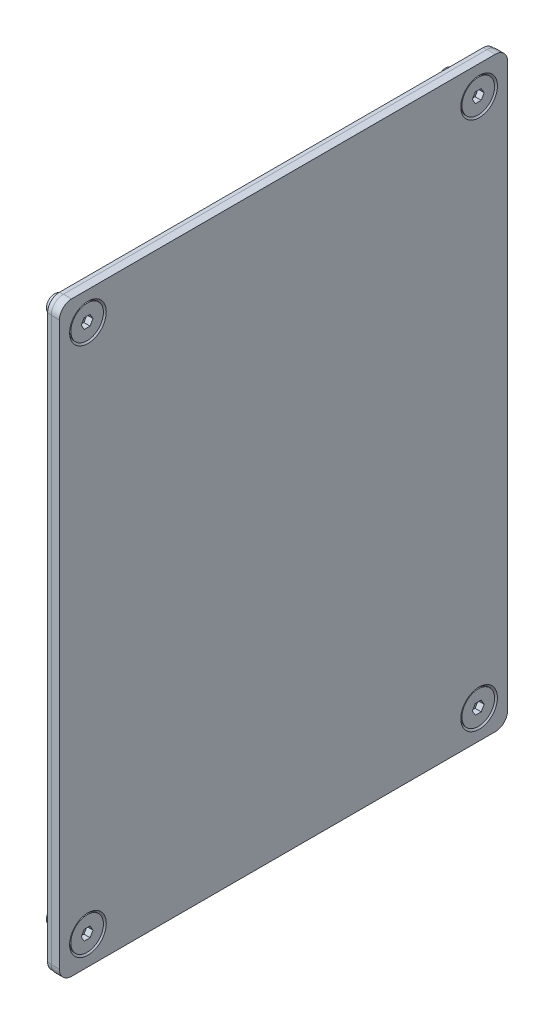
ISO-10303-21;
HEADER;
FILE_DESCRIPTION(('STEP AP214'),'2;1');
FILE_NAME('part.step','',(''),(''),'','','');
FILE_SCHEMA(('AUTOMOTIVE_DESIGN { 1 0 10303 214 1 1 1 1 }'));
ENDSEC;
DATA;
#1=APPLICATION_CONTEXT('core data for automotive mechanical design processes');
#2=APPLICATION_PROTOCOL_DEFINITION('international standard','automotive_design',2000,#1);
#3=PRODUCT_CONTEXT('',#1,'mechanical');
#4=PRODUCT('Part','Part','',(#3));
#5=PRODUCT_RELATED_PRODUCT_CATEGORY('part','',(#4));
#6=PRODUCT_DEFINITION_FORMATION('','',#4);
#7=PRODUCT_DEFINITION_CONTEXT('part definition',#1,'design');
#8=PRODUCT_DEFINITION('design','',#6,#7);
#9=PRODUCT_DEFINITION_SHAPE('','',#8);
#10=(LENGTH_UNIT() NAMED_UNIT(*) SI_UNIT(.MILLI.,.METRE.));
#11=(NAMED_UNIT(*) PLANE_ANGLE_UNIT() SI_UNIT($,.RADIAN.));
#12=(NAMED_UNIT(*) SI_UNIT($,.STERADIAN.) SOLID_ANGLE_UNIT());
#13=UNCERTAINTY_MEASURE_WITH_UNIT(LENGTH_MEASURE(1.E-05),#10,'distance_accuracy_value','');
#14=(GEOMETRIC_REPRESENTATION_CONTEXT(3) GLOBAL_UNCERTAINTY_ASSIGNED_CONTEXT((#13)) GLOBAL_UNIT_ASSIGNED_CONTEXT((#10,
#11,#12)) REPRESENTATION_CONTEXT('',''));
#15=CARTESIAN_POINT('',(0.,0.,0.));
#16=DIRECTION('',(0.,0.,1.));
#17=DIRECTION('',(1.,0.,0.));
#18=AXIS2_PLACEMENT_3D('',#15,#16,#17);
#19=CARTESIAN_POINT('',(-6.2,-65.,48.));
#20=DIRECTION('',(1.,0.,0.));
#21=DIRECTION('',(0.,0.,-1.));
#22=AXIS2_PLACEMENT_3D('',#19,#20,#21);
#23=PLANE('',#22);
#24=CARTESIAN_POINT('',(-6.2,-65.,48.));
#25=DIRECTION('',(1.,0.,0.));
#26=DIRECTION('',(0.,0.,-1.));
#27=AXIS2_PLACEMENT_3D('',#24,#25,#26);
#28=CIRCLE('',#27,2.);
#29=CARTESIAN_POINT('',(-6.2,-65.,46.));
#30=VERTEX_POINT('',#29);
#31=EDGE_CURVE('E20',#30,#30,#28,.T.);
#32=ORIENTED_EDGE('',*,*,#31,.F.);
#33=EDGE_LOOP('',(#32));
#34=FACE_BOUND('',#33,.T.);
#35=ADVANCED_FACE('F17',(#34),#23,.F.);
#36=CARTESIAN_POINT('',(-6.2,-65.,-48.));
#37=DIRECTION('',(1.,0.,0.));
#38=DIRECTION('',(0.,0.,-1.));
#39=AXIS2_PLACEMENT_3D('',#36,#37,#38);
#40=PLANE('',#39);
#41=CARTESIAN_POINT('',(-6.2,-65.,-48.));
#42=DIRECTION('',(1.,0.,0.));
#43=DIRECTION('',(0.,0.,-1.));
#44=AXIS2_PLACEMENT_3D('',#41,#42,#43);
#45=CIRCLE('',#44,2.);
#46=CARTESIAN_POINT('',(-6.2,-65.,-50.));
#47=VERTEX_POINT('',#46);
#48=EDGE_CURVE('E454',#47,#47,#45,.T.);
#49=ORIENTED_EDGE('',*,*,#48,.F.);
#50=EDGE_LOOP('',(#49));
#51=FACE_BOUND('',#50,.T.);
#52=ADVANCED_FACE('F469',(#51),#40,.F.);
#53=CARTESIAN_POINT('',(-6.2,65.,-48.));
#54=DIRECTION('',(1.,0.,0.));
#55=DIRECTION('',(0.,0.,-1.));
#56=AXIS2_PLACEMENT_3D('',#53,#54,#55);
#57=PLANE('',#56);
#58=CARTESIAN_POINT('',(-6.2,65.,-48.));
#59=DIRECTION('',(1.,0.,0.));
#60=DIRECTION('',(0.,0.,-1.));
#61=AXIS2_PLACEMENT_3D('',#58,#59,#60);
#62=CIRCLE('',#61,2.);
#63=CARTESIAN_POINT('',(-6.2,65.,-50.));
#64=VERTEX_POINT('',#63);
#65=EDGE_CURVE('E451',#64,#64,#62,.T.);
#66=ORIENTED_EDGE('',*,*,#65,.F.);
#67=EDGE_LOOP('',(#66));
#68=FACE_BOUND('',#67,.T.);
#69=ADVANCED_FACE('F474',(#68),#57,.F.);
#70=CARTESIAN_POINT('',(-6.2,65.,48.));
#71=DIRECTION('',(1.,0.,0.));
#72=DIRECTION('',(0.,0.,-1.));
#73=AXIS2_PLACEMENT_3D('',#70,#71,#72);
#74=PLANE('',#73);
#75=CARTESIAN_POINT('',(-6.2,65.,48.));
#76=DIRECTION('',(1.,0.,0.));
#77=DIRECTION('',(0.,0.,-1.));
#78=AXIS2_PLACEMENT_3D('',#75,#76,#77);
#79=CIRCLE('',#78,2.);
#80=CARTESIAN_POINT('',(-6.2,65.,46.));
#81=VERTEX_POINT('',#80);
#82=EDGE_CURVE('E242',#81,#81,#79,.T.);
#83=ORIENTED_EDGE('',*,*,#82,.F.);
#84=EDGE_LOOP('',(#83));
#85=FACE_BOUND('',#84,.T.);
#86=ADVANCED_FACE('F761',(#85),#74,.F.);
#87=CARTESIAN_POINT('',(0.,0.,0.));
#88=DIRECTION('',(1.,0.,0.));
#89=DIRECTION('',(0.,0.,-1.));
#90=AXIS2_PLACEMENT_3D('',#87,#88,#89);
#91=PLANE('',#90);
#92=DIRECTION('',(0.,-1.,0.));
#93=VECTOR('',#92,1.);
#94=CARTESIAN_POINT('',(0.,-48.,49.));
#95=LINE('',#94,#93);
#96=CARTESIAN_POINT('',(0.,-48.,49.));
#97=VERTEX_POINT('',#96);
#98=CARTESIAN_POINT('',(0.,48.,49.));
#99=VERTEX_POINT('',#98);
#100=EDGE_CURVE('E245',#97,#99,#95,.F.);
#101=ORIENTED_EDGE('',*,*,#100,.T.);
#102=CARTESIAN_POINT('',(0.,48.,34.));
#103=DIRECTION('',(1.,0.,0.));
#104=DIRECTION('',(0.,0.,-1.));
#105=AXIS2_PLACEMENT_3D('',#102,#103,#104);
#106=CIRCLE('',#105,15.);
#107=CARTESIAN_POINT('',(0.,63.,34.));
#108=VERTEX_POINT('',#107);
#109=EDGE_CURVE('E231',#99,#108,#106,.F.);
#110=ORIENTED_EDGE('',*,*,#109,.T.);
#111=DIRECTION('',(0.,0.,1.));
#112=VECTOR('',#111,1.);
#113=CARTESIAN_POINT('',(0.,63.,-34.));
#114=LINE('',#113,#112);
#115=CARTESIAN_POINT('',(0.,63.,-34.));
#116=VERTEX_POINT('',#115);
#117=EDGE_CURVE('E295',#108,#116,#114,.F.);
#118=ORIENTED_EDGE('',*,*,#117,.T.);
#119=CARTESIAN_POINT('',(0.,48.,-34.));
#120=DIRECTION('',(1.,0.,0.));
#121=DIRECTION('',(0.,0.,-1.));
#122=AXIS2_PLACEMENT_3D('',#119,#120,#121);
#123=CIRCLE('',#122,15.);
#124=CARTESIAN_POINT('',(0.,48.,-49.));
#125=VERTEX_POINT('',#124);
#126=EDGE_CURVE('E290',#116,#125,#123,.F.);
#127=ORIENTED_EDGE('',*,*,#126,.T.);
#128=DIRECTION('',(0.,1.,0.));
#129=VECTOR('',#128,1.);
#130=CARTESIAN_POINT('',(0.,48.,-49.));
#131=LINE('',#130,#129);
#132=CARTESIAN_POINT('',(0.,-48.,-49.));
#133=VERTEX_POINT('',#132);
#134=EDGE_CURVE('E285',#125,#133,#131,.F.);
#135=ORIENTED_EDGE('',*,*,#134,.T.);
#136=CARTESIAN_POINT('',(0.,-48.,-34.));
#137=DIRECTION('',(1.,0.,0.));
#138=DIRECTION('',(0.,0.,-1.));
#139=AXIS2_PLACEMENT_3D('',#136,#137,#138);
#140=CIRCLE('',#139,15.);
#141=CARTESIAN_POINT('',(0.,-63.,-34.));
#142=VERTEX_POINT('',#141);
#143=EDGE_CURVE('E280',#133,#142,#140,.F.);
#144=ORIENTED_EDGE('',*,*,#143,.T.);
#145=DIRECTION('',(0.,0.,-1.));
#146=VECTOR('',#145,1.);
#147=CARTESIAN_POINT('',(0.,-63.,-34.));
#148=LINE('',#147,#146);
#149=CARTESIAN_POINT('',(0.,-63.,34.));
#150=VERTEX_POINT('',#149);
#151=EDGE_CURVE('E275',#142,#150,#148,.F.);
#152=ORIENTED_EDGE('',*,*,#151,.T.);
#153=CARTESIAN_POINT('',(0.,-48.,34.));
#154=DIRECTION('',(1.,0.,0.));
#155=DIRECTION('',(0.,0.,-1.));
#156=AXIS2_PLACEMENT_3D('',#153,#154,#155);
#157=CIRCLE('',#156,15.);
#158=EDGE_CURVE('E248',#150,#97,#157,.F.);
#159=ORIENTED_EDGE('',*,*,#158,.T.);
#160=EDGE_LOOP('',(#101,#110,#118,#127,#135,#144,#152,#159));
#161=FACE_BOUND('',#160,.T.);
#162=ADVANCED_FACE('F246',(#161),#91,.F.);
#163=CARTESIAN_POINT('',(0.3,0.,0.));
#164=DIRECTION('',(1.,0.,0.));
#165=DIRECTION('',(0.,0.,-1.));
#166=AXIS2_PLACEMENT_3D('',#163,#164,#165);
#167=PLANE('',#166);
#168=DIRECTION('',(0.,-0.866025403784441,0.499999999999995));
#169=VECTOR('',#168,1.);
#170=CARTESIAN_POINT('',(0.3,66.25,48.721687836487));
#171=LINE('',#170,#169);
#172=CARTESIAN_POINT('',(0.3,66.25,48.721687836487));
#173=VERTEX_POINT('',#172);
#174=CARTESIAN_POINT('',(0.3,65.,49.4433756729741));
#175=VERTEX_POINT('',#174);
#176=EDGE_CURVE('E1247',#173,#175,#171,.T.);
#177=ORIENTED_EDGE('',*,*,#176,.T.);
#178=DIRECTION('',(0.,-0.866025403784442,-0.499999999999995));
#179=VECTOR('',#178,1.);
#180=CARTESIAN_POINT('',(0.3,65.,49.4433756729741));
#181=LINE('',#180,#179);
#182=CARTESIAN_POINT('',(0.3,63.75,48.721687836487));
#183=VERTEX_POINT('',#182);
#184=EDGE_CURVE('E1250',#175,#183,#181,.T.);
#185=ORIENTED_EDGE('',*,*,#184,.T.);
#186=DIRECTION('',(0.,0.,-1.));
#187=VECTOR('',#186,1.);
#188=CARTESIAN_POINT('',(0.3,63.75,48.721687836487));
#189=LINE('',#188,#187);
#190=CARTESIAN_POINT('',(0.3,63.75,47.278312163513));
#191=VERTEX_POINT('',#190);
#192=EDGE_CURVE('E253',#183,#191,#189,.T.);
#193=ORIENTED_EDGE('',*,*,#192,.T.);
#194=DIRECTION('',(0.,0.866025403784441,-0.499999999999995));
#195=VECTOR('',#194,1.);
#196=CARTESIAN_POINT('',(0.3,63.75,47.278312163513));
#197=LINE('',#196,#195);
#198=CARTESIAN_POINT('',(0.3,65.,46.5566243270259));
#199=VERTEX_POINT('',#198);
#200=EDGE_CURVE('E1290',#191,#199,#197,.T.);
#201=ORIENTED_EDGE('',*,*,#200,.T.);
#202=DIRECTION('',(0.,0.86602540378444,0.499999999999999));
#203=VECTOR('',#202,1.);
#204=CARTESIAN_POINT('',(0.3,65.,46.5566243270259));
#205=LINE('',#204,#203);
#206=CARTESIAN_POINT('',(0.3,66.25,47.278312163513));
#207=VERTEX_POINT('',#206);
#208=EDGE_CURVE('E1317',#199,#207,#205,.T.);
#209=ORIENTED_EDGE('',*,*,#208,.T.);
#210=DIRECTION('',(0.,0.,1.));
#211=VECTOR('',#210,1.);
#212=CARTESIAN_POINT('',(0.3,66.25,47.278312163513));
#213=LINE('',#212,#211);
#214=EDGE_CURVE('E1255',#207,#173,#213,.T.);
#215=ORIENTED_EDGE('',*,*,#214,.T.);
#216=EDGE_LOOP('',(#177,#185,#193,#201,#209,#215));
#217=FACE_BOUND('',#216,.T.);
#218=ADVANCED_FACE('F754',(#217),#167,.T.);
#219=CARTESIAN_POINT('',(0.3,0.,0.));
#220=DIRECTION('',(1.,0.,0.));
#221=DIRECTION('',(0.,0.,-1.));
#222=AXIS2_PLACEMENT_3D('',#219,#220,#221);
#223=PLANE('',#222);
#224=DIRECTION('',(0.,-0.866025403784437,0.500000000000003));
#225=VECTOR('',#224,1.);
#226=CARTESIAN_POINT('',(0.3,66.25,-47.278312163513));
#227=LINE('',#226,#225);
#228=CARTESIAN_POINT('',(0.3,66.25,-47.278312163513));
#229=VERTEX_POINT('',#228);
#230=CARTESIAN_POINT('',(0.3,65.,-46.5566243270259));
#231=VERTEX_POINT('',#230);
#232=EDGE_CURVE('E1490',#229,#231,#227,.T.);
#233=ORIENTED_EDGE('',*,*,#232,.T.);
#234=DIRECTION('',(0.,-0.866025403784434,-0.500000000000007));
#235=VECTOR('',#234,1.);
#236=CARTESIAN_POINT('',(0.3,65.,-46.5566243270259));
#237=LINE('',#236,#235);
#238=CARTESIAN_POINT('',(0.3,63.75,-47.278312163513));
#239=VERTEX_POINT('',#238);
#240=EDGE_CURVE('E1498',#231,#239,#237,.T.);
#241=ORIENTED_EDGE('',*,*,#240,.T.);
#242=DIRECTION('',(0.,0.,-1.));
#243=VECTOR('',#242,1.);
#244=CARTESIAN_POINT('',(0.3,63.75,-47.278312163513));
#245=LINE('',#244,#243);
#246=CARTESIAN_POINT('',(0.3,63.75,-48.721687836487));
#247=VERTEX_POINT('',#246);
#248=EDGE_CURVE('E1310',#239,#247,#245,.T.);
#249=ORIENTED_EDGE('',*,*,#248,.T.);
#250=DIRECTION('',(0.,0.866025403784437,-0.500000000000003));
#251=VECTOR('',#250,1.);
#252=CARTESIAN_POINT('',(0.3,63.75,-48.721687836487));
#253=LINE('',#252,#251);
#254=CARTESIAN_POINT('',(0.3,65.,-49.4433756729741));
#255=VERTEX_POINT('',#254);
#256=EDGE_CURVE('E1462',#247,#255,#253,.T.);
#257=ORIENTED_EDGE('',*,*,#256,.T.);
#258=DIRECTION('',(0.,0.866025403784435,0.500000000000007));
#259=VECTOR('',#258,1.);
#260=CARTESIAN_POINT('',(0.3,65.,-49.4433756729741));
#261=LINE('',#260,#259);
#262=CARTESIAN_POINT('',(0.3,66.25,-48.721687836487));
#263=VERTEX_POINT('',#262);
#264=EDGE_CURVE('E1474',#255,#263,#261,.T.);
#265=ORIENTED_EDGE('',*,*,#264,.T.);
#266=DIRECTION('',(0.,0.,1.));
#267=VECTOR('',#266,1.);
#268=CARTESIAN_POINT('',(0.3,66.25,-48.721687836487));
#269=LINE('',#268,#267);
#270=EDGE_CURVE('E1482',#263,#229,#269,.T.);
#271=ORIENTED_EDGE('',*,*,#270,.T.);
#272=EDGE_LOOP('',(#233,#241,#249,#257,#265,#271));
#273=FACE_BOUND('',#272,.T.);
#274=ADVANCED_FACE('F750',(#273),#223,.T.);
#275=CARTESIAN_POINT('',(0.3,0.,0.));
#276=DIRECTION('',(1.,0.,0.));
#277=DIRECTION('',(0.,0.,-1.));
#278=AXIS2_PLACEMENT_3D('',#275,#276,#277);
#279=PLANE('',#278);
#280=DIRECTION('',(0.,-0.866025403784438,0.500000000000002));
#281=VECTOR('',#280,1.);
#282=CARTESIAN_POINT('',(0.3,-63.75,-47.278312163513));
#283=LINE('',#282,#281);
#284=CARTESIAN_POINT('',(0.3,-63.75,-47.278312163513));
#285=VERTEX_POINT('',#284);
#286=CARTESIAN_POINT('',(0.3,-65.,-46.5566243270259));
#287=VERTEX_POINT('',#286);
#288=EDGE_CURVE('E1442',#285,#287,#283,.T.);
#289=ORIENTED_EDGE('',*,*,#288,.T.);
#290=DIRECTION('',(0.,-0.866025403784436,-0.500000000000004));
#291=VECTOR('',#290,1.);
#292=CARTESIAN_POINT('',(0.3,-65.,-46.5566243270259));
#293=LINE('',#292,#291);
#294=CARTESIAN_POINT('',(0.3,-66.25,-47.278312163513));
#295=VERTEX_POINT('',#294);
#296=EDGE_CURVE('E1450',#287,#295,#293,.T.);
#297=ORIENTED_EDGE('',*,*,#296,.T.);
#298=DIRECTION('',(0.,0.,-1.));
#299=VECTOR('',#298,1.);
#300=CARTESIAN_POINT('',(0.3,-66.25,-47.278312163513));
#301=LINE('',#300,#299);
#302=CARTESIAN_POINT('',(0.3,-66.25,-48.721687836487));
#303=VERTEX_POINT('',#302);
#304=EDGE_CURVE('E1454',#295,#303,#301,.T.);
#305=ORIENTED_EDGE('',*,*,#304,.T.);
#306=DIRECTION('',(0.,0.866025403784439,-0.499999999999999));
#307=VECTOR('',#306,1.);
#308=CARTESIAN_POINT('',(0.3,-66.25,-48.721687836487));
#309=LINE('',#308,#307);
#310=CARTESIAN_POINT('',(0.3,-65.,-49.4433756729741));
#311=VERTEX_POINT('',#310);
#312=EDGE_CURVE('E1416',#303,#311,#309,.T.);
#313=ORIENTED_EDGE('',*,*,#312,.T.);
#314=DIRECTION('',(0.,0.866025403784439,0.499999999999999));
#315=VECTOR('',#314,1.);
#316=CARTESIAN_POINT('',(0.3,-65.,-49.4433756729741));
#317=LINE('',#316,#315);
#318=CARTESIAN_POINT('',(0.3,-63.75,-48.721687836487));
#319=VERTEX_POINT('',#318);
#320=EDGE_CURVE('E1427',#311,#319,#317,.T.);
#321=ORIENTED_EDGE('',*,*,#320,.T.);
#322=DIRECTION('',(0.,0.,1.));
#323=VECTOR('',#322,1.);
#324=CARTESIAN_POINT('',(0.3,-63.75,-48.721687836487));
#325=LINE('',#324,#323);
#326=EDGE_CURVE('E1434',#319,#285,#325,.T.);
#327=ORIENTED_EDGE('',*,*,#326,.T.);
#328=EDGE_LOOP('',(#289,#297,#305,#313,#321,#327));
#329=FACE_BOUND('',#328,.T.);
#330=ADVANCED_FACE('F746',(#329),#279,.T.);
#331=CARTESIAN_POINT('',(0.3,0.,0.));
#332=DIRECTION('',(1.,0.,0.));
#333=DIRECTION('',(0.,0.,-1.));
#334=AXIS2_PLACEMENT_3D('',#331,#332,#333);
#335=PLANE('',#334);
#336=DIRECTION('',(0.,-0.866025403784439,0.499999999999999));
#337=VECTOR('',#336,1.);
#338=CARTESIAN_POINT('',(0.3,-63.75,48.721687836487));
#339=LINE('',#338,#337);
#340=CARTESIAN_POINT('',(0.3,-63.75,48.721687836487));
#341=VERTEX_POINT('',#340);
#342=CARTESIAN_POINT('',(0.3,-65.,49.4433756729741));
#343=VERTEX_POINT('',#342);
#344=EDGE_CURVE('E1396',#341,#343,#339,.T.);
#345=ORIENTED_EDGE('',*,*,#344,.T.);
#346=DIRECTION('',(0.,-0.86602540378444,-0.499999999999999));
#347=VECTOR('',#346,1.);
#348=CARTESIAN_POINT('',(0.3,-65.,49.4433756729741));
#349=LINE('',#348,#347);
#350=CARTESIAN_POINT('',(0.3,-66.25,48.721687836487));
#351=VERTEX_POINT('',#350);
#352=EDGE_CURVE('E1404',#343,#351,#349,.T.);
#353=ORIENTED_EDGE('',*,*,#352,.T.);
#354=DIRECTION('',(0.,0.,-1.));
#355=VECTOR('',#354,1.);
#356=CARTESIAN_POINT('',(0.3,-66.25,48.721687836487));
#357=LINE('',#356,#355);
#358=CARTESIAN_POINT('',(0.3,-66.25,47.278312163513));
#359=VERTEX_POINT('',#358);
#360=EDGE_CURVE('E1408',#351,#359,#357,.T.);
#361=ORIENTED_EDGE('',*,*,#360,.T.);
#362=DIRECTION('',(0.,0.866025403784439,-0.499999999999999));
#363=VECTOR('',#362,1.);
#364=CARTESIAN_POINT('',(0.3,-66.25,47.278312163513));
#365=LINE('',#364,#363);
#366=CARTESIAN_POINT('',(0.3,-65.,46.5566243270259));
#367=VERTEX_POINT('',#366);
#368=EDGE_CURVE('E1368',#359,#367,#365,.T.);
#369=ORIENTED_EDGE('',*,*,#368,.T.);
#370=DIRECTION('',(0.,0.86602540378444,0.499999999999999));
#371=VECTOR('',#370,1.);
#372=CARTESIAN_POINT('',(0.3,-65.,46.5566243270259));
#373=LINE('',#372,#371);
#374=CARTESIAN_POINT('',(0.3,-63.75,47.278312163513));
#375=VERTEX_POINT('',#374);
#376=EDGE_CURVE('E1380',#367,#375,#373,.T.);
#377=ORIENTED_EDGE('',*,*,#376,.T.);
#378=DIRECTION('',(0.,0.,1.));
#379=VECTOR('',#378,1.);
#380=CARTESIAN_POINT('',(0.3,-63.75,47.278312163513));
#381=LINE('',#380,#379);
#382=EDGE_CURVE('E1388',#375,#341,#381,.T.);
#383=ORIENTED_EDGE('',*,*,#382,.T.);
#384=EDGE_LOOP('',(#345,#353,#361,#369,#377,#383));
#385=FACE_BOUND('',#384,.T.);
#386=ADVANCED_FACE('F742',(#385),#335,.T.);
#387=CARTESIAN_POINT('',(-6.2,-65.,48.));
#388=DIRECTION('',(1.,0.,0.));
#389=DIRECTION('',(0.,0.,-1.));
#390=AXIS2_PLACEMENT_3D('',#387,#388,#389);
#391=CYLINDRICAL_SURFACE('',#390,2.);
#392=CARTESIAN_POINT('',(-1.,-65.,48.));
#393=DIRECTION('',(1.,0.,0.));
#394=DIRECTION('',(0.,0.,-1.));
#395=AXIS2_PLACEMENT_3D('',#392,#393,#394);
#396=CIRCLE('',#395,2.);
#397=CARTESIAN_POINT('',(-1.,-65.,46.));
#398=VERTEX_POINT('',#397);
#399=EDGE_CURVE('E439',#398,#398,#396,.F.);
#400=ORIENTED_EDGE('',*,*,#399,.T.);
#401=EDGE_LOOP('',(#400));
#402=FACE_BOUND('',#401,.T.);
#403=ORIENTED_EDGE('',*,*,#31,.T.);
#404=EDGE_LOOP('',(#403));
#405=FACE_BOUND('',#404,.T.);
#406=ADVANCED_FACE('F466',(#402,#405),#391,.T.);
#407=CARTESIAN_POINT('',(-6.2,-65.,-48.));
#408=DIRECTION('',(1.,0.,0.));
#409=DIRECTION('',(0.,0.,-1.));
#410=AXIS2_PLACEMENT_3D('',#407,#408,#409);
#411=CYLINDRICAL_SURFACE('',#410,2.);
#412=CARTESIAN_POINT('',(-1.,-65.,-48.));
#413=DIRECTION('',(1.,0.,0.));
#414=DIRECTION('',(0.,0.,-1.));
#415=AXIS2_PLACEMENT_3D('',#412,#413,#414);
#416=CIRCLE('',#415,2.);
#417=CARTESIAN_POINT('',(-1.,-65.,-50.));
#418=VERTEX_POINT('',#417);
#419=EDGE_CURVE('E435',#418,#418,#416,.F.);
#420=ORIENTED_EDGE('',*,*,#419,.T.);
#421=EDGE_LOOP('',(#420));
#422=FACE_BOUND('',#421,.T.);
#423=ORIENTED_EDGE('',*,*,#48,.T.);
#424=EDGE_LOOP('',(#423));
#425=FACE_BOUND('',#424,.T.);
#426=ADVANCED_FACE('F735',(#422,#425),#411,.T.);
#427=CARTESIAN_POINT('',(-6.2,65.,-48.));
#428=DIRECTION('',(1.,0.,0.));
#429=DIRECTION('',(0.,0.,-1.));
#430=AXIS2_PLACEMENT_3D('',#427,#428,#429);
#431=CYLINDRICAL_SURFACE('',#430,2.);
#432=CARTESIAN_POINT('',(-1.,65.,-48.));
#433=DIRECTION('',(1.,0.,0.));
#434=DIRECTION('',(0.,0.,-1.));
#435=AXIS2_PLACEMENT_3D('',#432,#433,#434);
#436=CIRCLE('',#435,2.);
#437=CARTESIAN_POINT('',(-1.,65.,-50.));
#438=VERTEX_POINT('',#437);
#439=EDGE_CURVE('E431',#438,#438,#436,.F.);
#440=ORIENTED_EDGE('',*,*,#439,.T.);
#441=EDGE_LOOP('',(#440));
#442=FACE_BOUND('',#441,.T.);
#443=ORIENTED_EDGE('',*,*,#65,.T.);
#444=EDGE_LOOP('',(#443));
#445=FACE_BOUND('',#444,.T.);
#446=ADVANCED_FACE('F731',(#442,#445),#431,.T.);
#447=CARTESIAN_POINT('',(-6.2,65.,48.));
#448=DIRECTION('',(1.,0.,0.));
#449=DIRECTION('',(0.,0.,-1.));
#450=AXIS2_PLACEMENT_3D('',#447,#448,#449);
#451=CYLINDRICAL_SURFACE('',#450,2.);
#452=CARTESIAN_POINT('',(-1.,65.,48.));
#453=DIRECTION('',(1.,0.,0.));
#454=DIRECTION('',(0.,0.,-1.));
#455=AXIS2_PLACEMENT_3D('',#452,#453,#454);
#456=CIRCLE('',#455,2.);
#457=CARTESIAN_POINT('',(-1.,65.,46.));
#458=VERTEX_POINT('',#457);
#459=EDGE_CURVE('E427',#458,#458,#456,.F.);
#460=ORIENTED_EDGE('',*,*,#459,.T.);
#461=EDGE_LOOP('',(#460));
#462=FACE_BOUND('',#461,.T.);
#463=ORIENTED_EDGE('',*,*,#82,.T.);
#464=EDGE_LOOP('',(#463));
#465=FACE_BOUND('',#464,.T.);
#466=ADVANCED_FACE('F728',(#462,#465),#451,.T.);
#467=CARTESIAN_POINT('',(-1.,48.,34.));
#468=DIRECTION('',(1.,0.,0.));
#469=DIRECTION('',(0.,0.,-1.));
#470=AXIS2_PLACEMENT_3D('',#467,#468,#469);
#471=CYLINDRICAL_SURFACE('',#470,15.);
#472=DIRECTION('',(1.,0.,0.));
#473=VECTOR('',#472,1.);
#474=CARTESIAN_POINT('',(-1.,48.,49.));
#475=LINE('',#474,#473);
#476=CARTESIAN_POINT('',(-1.,48.,49.));
#477=VERTEX_POINT('',#476);
#478=EDGE_CURVE('E235',#99,#477,#475,.F.);
#479=ORIENTED_EDGE('',*,*,#478,.T.);
#480=CARTESIAN_POINT('',(-1.,48.,34.));
#481=DIRECTION('',(1.,0.,0.));
#482=DIRECTION('',(0.,0.,-1.));
#483=AXIS2_PLACEMENT_3D('',#480,#481,#482);
#484=CIRCLE('',#483,15.);
#485=CARTESIAN_POINT('',(-1.,63.,34.));
#486=VERTEX_POINT('',#485);
#487=EDGE_CURVE('E425',#477,#486,#484,.F.);
#488=ORIENTED_EDGE('',*,*,#487,.T.);
#489=DIRECTION('',(1.,0.,0.));
#490=VECTOR('',#489,1.);
#491=CARTESIAN_POINT('',(-1.,63.,34.));
#492=LINE('',#491,#490);
#493=EDGE_CURVE('E238',#486,#108,#492,.T.);
#494=ORIENTED_EDGE('',*,*,#493,.T.);
#495=ORIENTED_EDGE('',*,*,#109,.F.);
#496=EDGE_LOOP('',(#479,#488,#494,#495));
#497=FACE_BOUND('',#496,.T.);
#498=ADVANCED_FACE('F233',(#497),#471,.F.);
#499=CARTESIAN_POINT('',(-1.,63.,-34.));
#500=DIRECTION('',(0.,1.,0.));
#501=DIRECTION('',(0.,0.,1.));
#502=AXIS2_PLACEMENT_3D('',#499,#500,#501);
#503=PLANE('',#502);
#504=ORIENTED_EDGE('',*,*,#493,.F.);
#505=DIRECTION('',(0.,0.,-1.));
#506=VECTOR('',#505,1.);
#507=CARTESIAN_POINT('',(-1.,63.,-52.));
#508=LINE('',#507,#506);
#509=CARTESIAN_POINT('',(-1.,63.,-34.));
#510=VERTEX_POINT('',#509);
#511=EDGE_CURVE('E424',#486,#510,#508,.T.);
#512=ORIENTED_EDGE('',*,*,#511,.T.);
#513=DIRECTION('',(1.,0.,0.));
#514=VECTOR('',#513,1.);
#515=CARTESIAN_POINT('',(-1.,63.,-34.));
#516=LINE('',#515,#514);
#517=EDGE_CURVE('E291',#510,#116,#516,.T.);
#518=ORIENTED_EDGE('',*,*,#517,.T.);
#519=ORIENTED_EDGE('',*,*,#117,.F.);
#520=EDGE_LOOP('',(#504,#512,#518,#519));
#521=FACE_BOUND('',#520,.T.);
#522=ADVANCED_FACE('F721',(#521),#503,.F.);
#523=CARTESIAN_POINT('',(-1.,48.,-34.));
#524=DIRECTION('',(1.,0.,0.));
#525=DIRECTION('',(0.,0.,-1.));
#526=AXIS2_PLACEMENT_3D('',#523,#524,#525);
#527=CYLINDRICAL_SURFACE('',#526,15.);
#528=ORIENTED_EDGE('',*,*,#517,.F.);
#529=CARTESIAN_POINT('',(-1.,48.,-34.));
#530=DIRECTION('',(1.,0.,0.));
#531=DIRECTION('',(0.,0.,-1.));
#532=AXIS2_PLACEMENT_3D('',#529,#530,#531);
#533=CIRCLE('',#532,15.);
#534=CARTESIAN_POINT('',(-1.,48.,-49.));
#535=VERTEX_POINT('',#534);
#536=EDGE_CURVE('E421',#510,#535,#533,.F.);
#537=ORIENTED_EDGE('',*,*,#536,.T.);
#538=DIRECTION('',(-1.,0.,0.));
#539=VECTOR('',#538,1.);
#540=CARTESIAN_POINT('',(-1.,48.,-49.));
#541=LINE('',#540,#539);
#542=EDGE_CURVE('E286',#535,#125,#541,.F.);
#543=ORIENTED_EDGE('',*,*,#542,.T.);
#544=ORIENTED_EDGE('',*,*,#126,.F.);
#545=EDGE_LOOP('',(#528,#537,#543,#544));
#546=FACE_BOUND('',#545,.T.);
#547=ADVANCED_FACE('F717',(#546),#527,.F.);
#548=CARTESIAN_POINT('',(-1.,48.,-49.));
#549=DIRECTION('',(0.,0.,-1.));
#550=DIRECTION('',(-1.,0.,0.));
#551=AXIS2_PLACEMENT_3D('',#548,#549,#550);
#552=PLANE('',#551);
#553=ORIENTED_EDGE('',*,*,#542,.F.);
#554=DIRECTION('',(0.,1.,0.));
#555=VECTOR('',#554,1.);
#556=CARTESIAN_POINT('',(-1.,-69.,-49.));
#557=LINE('',#556,#555);
#558=CARTESIAN_POINT('',(-1.,-48.,-49.));
#559=VERTEX_POINT('',#558);
#560=EDGE_CURVE('E420',#535,#559,#557,.F.);
#561=ORIENTED_EDGE('',*,*,#560,.T.);
#562=DIRECTION('',(1.,0.,0.));
#563=VECTOR('',#562,1.);
#564=CARTESIAN_POINT('',(-1.,-48.,-49.));
#565=LINE('',#564,#563);
#566=EDGE_CURVE('E281',#559,#133,#565,.T.);
#567=ORIENTED_EDGE('',*,*,#566,.T.);
#568=ORIENTED_EDGE('',*,*,#134,.F.);
#569=EDGE_LOOP('',(#553,#561,#567,#568));
#570=FACE_BOUND('',#569,.T.);
#571=ADVANCED_FACE('F713',(#570),#552,.F.);
#572=CARTESIAN_POINT('',(-1.,-48.,-34.));
#573=DIRECTION('',(1.,0.,0.));
#574=DIRECTION('',(0.,0.,-1.));
#575=AXIS2_PLACEMENT_3D('',#572,#573,#574);
#576=CYLINDRICAL_SURFACE('',#575,15.);
#577=ORIENTED_EDGE('',*,*,#566,.F.);
#578=CARTESIAN_POINT('',(-1.,-48.,-34.));
#579=DIRECTION('',(1.,0.,0.));
#580=DIRECTION('',(0.,0.,-1.));
#581=AXIS2_PLACEMENT_3D('',#578,#579,#580);
#582=CIRCLE('',#581,15.);
#583=CARTESIAN_POINT('',(-1.,-63.,-34.));
#584=VERTEX_POINT('',#583);
#585=EDGE_CURVE('E417',#559,#584,#582,.F.);
#586=ORIENTED_EDGE('',*,*,#585,.T.);
#587=DIRECTION('',(1.,0.,0.));
#588=VECTOR('',#587,1.);
#589=CARTESIAN_POINT('',(-1.,-63.,-34.));
#590=LINE('',#589,#588);
#591=EDGE_CURVE('E276',#584,#142,#590,.T.);
#592=ORIENTED_EDGE('',*,*,#591,.T.);
#593=ORIENTED_EDGE('',*,*,#143,.F.);
#594=EDGE_LOOP('',(#577,#586,#592,#593));
#595=FACE_BOUND('',#594,.T.);
#596=ADVANCED_FACE('F709',(#595),#576,.F.);
#597=CARTESIAN_POINT('',(-1.,-63.,-34.));
#598=DIRECTION('',(0.,-1.,0.));
#599=DIRECTION('',(0.,0.,-1.));
#600=AXIS2_PLACEMENT_3D('',#597,#598,#599);
#601=PLANE('',#600);
#602=ORIENTED_EDGE('',*,*,#591,.F.);
#603=DIRECTION('',(0.,0.,-1.));
#604=VECTOR('',#603,1.);
#605=CARTESIAN_POINT('',(-1.,-63.,-52.));
#606=LINE('',#605,#604);
#607=CARTESIAN_POINT('',(-1.,-63.,34.));
#608=VERTEX_POINT('',#607);
#609=EDGE_CURVE('E416',#584,#608,#606,.F.);
#610=ORIENTED_EDGE('',*,*,#609,.T.);
#611=DIRECTION('',(1.,0.,0.));
#612=VECTOR('',#611,1.);
#613=CARTESIAN_POINT('',(-1.,-63.,34.));
#614=LINE('',#613,#612);
#615=EDGE_CURVE('E268',#608,#150,#614,.T.);
#616=ORIENTED_EDGE('',*,*,#615,.T.);
#617=ORIENTED_EDGE('',*,*,#151,.F.);
#618=EDGE_LOOP('',(#602,#610,#616,#617));
#619=FACE_BOUND('',#618,.T.);
#620=ADVANCED_FACE('F705',(#619),#601,.F.);
#621=CARTESIAN_POINT('',(-1.,-48.,34.));
#622=DIRECTION('',(1.,0.,0.));
#623=DIRECTION('',(0.,0.,-1.));
#624=AXIS2_PLACEMENT_3D('',#621,#622,#623);
#625=CYLINDRICAL_SURFACE('',#624,15.);
#626=ORIENTED_EDGE('',*,*,#615,.F.);
#627=CARTESIAN_POINT('',(-1.,-48.,34.));
#628=DIRECTION('',(1.,0.,0.));
#629=DIRECTION('',(0.,0.,-1.));
#630=AXIS2_PLACEMENT_3D('',#627,#628,#629);
#631=CIRCLE('',#630,15.);
#632=CARTESIAN_POINT('',(-1.,-48.,49.));
#633=VERTEX_POINT('',#632);
#634=EDGE_CURVE('E413',#608,#633,#631,.F.);
#635=ORIENTED_EDGE('',*,*,#634,.T.);
#636=DIRECTION('',(1.,0.,0.));
#637=VECTOR('',#636,1.);
#638=CARTESIAN_POINT('',(-1.,-48.,49.));
#639=LINE('',#638,#637);
#640=EDGE_CURVE('E254',#633,#97,#639,.T.);
#641=ORIENTED_EDGE('',*,*,#640,.T.);
#642=ORIENTED_EDGE('',*,*,#158,.F.);
#643=EDGE_LOOP('',(#626,#635,#641,#642));
#644=FACE_BOUND('',#643,.T.);
#645=ADVANCED_FACE('F702',(#644),#625,.F.);
#646=CARTESIAN_POINT('',(-1.,-48.,49.));
#647=DIRECTION('',(0.,0.,1.));
#648=DIRECTION('',(0.,-1.,0.));
#649=AXIS2_PLACEMENT_3D('',#646,#647,#648);
#650=PLANE('',#649);
#651=ORIENTED_EDGE('',*,*,#640,.F.);
#652=DIRECTION('',(0.,1.,0.));
#653=VECTOR('',#652,1.);
#654=CARTESIAN_POINT('',(-1.,-69.,49.));
#655=LINE('',#654,#653);
#656=EDGE_CURVE('E258',#633,#477,#655,.T.);
#657=ORIENTED_EDGE('',*,*,#656,.T.);
#658=ORIENTED_EDGE('',*,*,#478,.F.);
#659=ORIENTED_EDGE('',*,*,#100,.F.);
#660=EDGE_LOOP('',(#651,#657,#658,#659));
#661=FACE_BOUND('',#660,.T.);
#662=ADVANCED_FACE('F256',(#661),#650,.F.);
#663=CARTESIAN_POINT('',(0.3,63.75,48.721687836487));
#664=DIRECTION('',(0.,-1.,0.));
#665=DIRECTION('',(0.,0.,-1.));
#666=AXIS2_PLACEMENT_3D('',#663,#664,#665);
#667=PLANE('',#666);
#668=DIRECTION('',(1.,0.,0.));
#669=VECTOR('',#668,1.);
#670=CARTESIAN_POINT('',(0.3,63.75,47.278312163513));
#671=LINE('',#670,#669);
#672=CARTESIAN_POINT('',(1.8,63.75,47.278312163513));
#673=VERTEX_POINT('',#672);
#674=EDGE_CURVE('E1297',#673,#191,#671,.F.);
#675=ORIENTED_EDGE('',*,*,#674,.T.);
#676=ORIENTED_EDGE('',*,*,#192,.F.);
#677=DIRECTION('',(1.,0.,0.));
#678=VECTOR('',#677,1.);
#679=CARTESIAN_POINT('',(0.3,63.75,48.721687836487));
#680=LINE('',#679,#678);
#681=CARTESIAN_POINT('',(1.8,63.75,48.721687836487));
#682=VERTEX_POINT('',#681);
#683=EDGE_CURVE('E1261',#183,#682,#680,.T.);
#684=ORIENTED_EDGE('',*,*,#683,.T.);
#685=DIRECTION('',(0.,0.,-1.));
#686=VECTOR('',#685,1.);
#687=CARTESIAN_POINT('',(1.8,63.75,48.));
#688=LINE('',#687,#686);
#689=EDGE_CURVE('E1299',#673,#682,#688,.F.);
#690=ORIENTED_EDGE('',*,*,#689,.F.);
#691=EDGE_LOOP('',(#675,#676,#684,#690));
#692=FACE_BOUND('',#691,.T.);
#693=ADVANCED_FACE('F695',(#692),#667,.F.);
#694=CARTESIAN_POINT('',(0.3,65.,49.4433756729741));
#695=DIRECTION('',(0.,-0.499999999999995,0.866025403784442));
#696=DIRECTION('',(0.,-0.866025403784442,-0.499999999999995));
#697=AXIS2_PLACEMENT_3D('',#694,#695,#696);
#698=PLANE('',#697);
#699=ORIENTED_EDGE('',*,*,#683,.F.);
#700=ORIENTED_EDGE('',*,*,#184,.F.);
#701=DIRECTION('',(1.,0.,0.));
#702=VECTOR('',#701,1.);
#703=CARTESIAN_POINT('',(0.3,65.,49.4433756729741));
#704=LINE('',#703,#702);
#705=CARTESIAN_POINT('',(1.8,65.,49.4433756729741));
#706=VERTEX_POINT('',#705);
#707=EDGE_CURVE('E1260',#175,#706,#704,.T.);
#708=ORIENTED_EDGE('',*,*,#707,.T.);
#709=DIRECTION('',(0.,0.866025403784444,0.499999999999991));
#710=VECTOR('',#709,1.);
#711=CARTESIAN_POINT('',(1.8,63.75,48.721687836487));
#712=LINE('',#711,#710);
#713=EDGE_CURVE('E1335',#682,#706,#712,.T.);
#714=ORIENTED_EDGE('',*,*,#713,.F.);
#715=EDGE_LOOP('',(#699,#700,#708,#714));
#716=FACE_BOUND('',#715,.T.);
#717=ADVANCED_FACE('F691',(#716),#698,.F.);
#718=CARTESIAN_POINT('',(0.3,66.25,48.721687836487));
#719=DIRECTION('',(0.,0.499999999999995,0.866025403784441));
#720=DIRECTION('',(0.,-0.866025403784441,0.499999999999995));
#721=AXIS2_PLACEMENT_3D('',#718,#719,#720);
#722=PLANE('',#721);
#723=ORIENTED_EDGE('',*,*,#707,.F.);
#724=ORIENTED_EDGE('',*,*,#176,.F.);
#725=DIRECTION('',(1.,0.,0.));
#726=VECTOR('',#725,1.);
#727=CARTESIAN_POINT('',(0.3,66.25,48.721687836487));
#728=LINE('',#727,#726);
#729=CARTESIAN_POINT('',(1.8,66.25,48.721687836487));
#730=VERTEX_POINT('',#729);
#731=EDGE_CURVE('E1277',#173,#730,#728,.T.);
#732=ORIENTED_EDGE('',*,*,#731,.T.);
#733=DIRECTION('',(0.,0.866025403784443,-0.499999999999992));
#734=VECTOR('',#733,1.);
#735=CARTESIAN_POINT('',(1.8,65.,49.4433756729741));
#736=LINE('',#735,#734);
#737=EDGE_CURVE('E1272',#706,#730,#736,.T.);
#738=ORIENTED_EDGE('',*,*,#737,.F.);
#739=EDGE_LOOP('',(#723,#724,#732,#738));
#740=FACE_BOUND('',#739,.T.);
#741=ADVANCED_FACE('F687',(#740),#722,.F.);
#742=CARTESIAN_POINT('',(0.3,66.25,47.278312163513));
#743=DIRECTION('',(0.,1.,0.));
#744=DIRECTION('',(0.,0.,1.));
#745=AXIS2_PLACEMENT_3D('',#742,#743,#744);
#746=PLANE('',#745);
#747=ORIENTED_EDGE('',*,*,#731,.F.);
#748=ORIENTED_EDGE('',*,*,#214,.F.);
#749=DIRECTION('',(1.,0.,0.));
#750=VECTOR('',#749,1.);
#751=CARTESIAN_POINT('',(0.3,66.25,47.278312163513));
#752=LINE('',#751,#750);
#753=CARTESIAN_POINT('',(1.8,66.25,47.278312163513));
#754=VERTEX_POINT('',#753);
#755=EDGE_CURVE('E1302',#207,#754,#752,.T.);
#756=ORIENTED_EDGE('',*,*,#755,.T.);
#757=DIRECTION('',(0.,0.,-1.));
#758=VECTOR('',#757,1.);
#759=CARTESIAN_POINT('',(1.8,66.25,48.));
#760=LINE('',#759,#758);
#761=EDGE_CURVE('E1327',#730,#754,#760,.T.);
#762=ORIENTED_EDGE('',*,*,#761,.F.);
#763=EDGE_LOOP('',(#747,#748,#756,#762));
#764=FACE_BOUND('',#763,.T.);
#765=ADVANCED_FACE('F683',(#764),#746,.F.);
#766=CARTESIAN_POINT('',(0.3,65.,46.5566243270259));
#767=DIRECTION('',(0.,0.499999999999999,-0.86602540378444));
#768=DIRECTION('',(0.,0.86602540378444,0.499999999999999));
#769=AXIS2_PLACEMENT_3D('',#766,#767,#768);
#770=PLANE('',#769);
#771=ORIENTED_EDGE('',*,*,#755,.F.);
#772=ORIENTED_EDGE('',*,*,#208,.F.);
#773=DIRECTION('',(1.,0.,0.));
#774=VECTOR('',#773,1.);
#775=CARTESIAN_POINT('',(0.3,65.,46.5566243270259));
#776=LINE('',#775,#774);
#777=CARTESIAN_POINT('',(1.8,65.,46.5566243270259));
#778=VERTEX_POINT('',#777);
#779=EDGE_CURVE('E1306',#199,#778,#776,.T.);
#780=ORIENTED_EDGE('',*,*,#779,.T.);
#781=DIRECTION('',(0.,-0.866025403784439,-0.499999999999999));
#782=VECTOR('',#781,1.);
#783=CARTESIAN_POINT('',(1.8,66.25,47.278312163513));
#784=LINE('',#783,#782);
#785=EDGE_CURVE('E1333',#754,#778,#784,.T.);
#786=ORIENTED_EDGE('',*,*,#785,.F.);
#787=EDGE_LOOP('',(#771,#772,#780,#786));
#788=FACE_BOUND('',#787,.T.);
#789=ADVANCED_FACE('F679',(#788),#770,.F.);
#790=CARTESIAN_POINT('',(0.3,63.75,47.278312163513));
#791=DIRECTION('',(0.,-0.499999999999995,-0.866025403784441));
#792=DIRECTION('',(0.,0.866025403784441,-0.499999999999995));
#793=AXIS2_PLACEMENT_3D('',#790,#791,#792);
#794=PLANE('',#793);
#795=ORIENTED_EDGE('',*,*,#779,.F.);
#796=ORIENTED_EDGE('',*,*,#200,.F.);
#797=ORIENTED_EDGE('',*,*,#674,.F.);
#798=DIRECTION('',(0.,-0.866025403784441,0.499999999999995));
#799=VECTOR('',#798,1.);
#800=CARTESIAN_POINT('',(1.8,65.,46.5566243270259));
#801=LINE('',#800,#799);
#802=EDGE_CURVE('E1621',#778,#673,#801,.T.);
#803=ORIENTED_EDGE('',*,*,#802,.F.);
#804=EDGE_LOOP('',(#795,#796,#797,#803));
#805=FACE_BOUND('',#804,.T.);
#806=ADVANCED_FACE('F675',(#805),#794,.F.);
#807=CARTESIAN_POINT('',(0.3,63.75,-47.278312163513));
#808=DIRECTION('',(0.,-1.,0.));
#809=DIRECTION('',(0.,0.,-1.));
#810=AXIS2_PLACEMENT_3D('',#807,#808,#809);
#811=PLANE('',#810);
#812=DIRECTION('',(1.,0.,0.));
#813=VECTOR('',#812,1.);
#814=CARTESIAN_POINT('',(0.3,63.75,-48.721687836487));
#815=LINE('',#814,#813);
#816=CARTESIAN_POINT('',(1.8,63.75,-48.721687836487));
#817=VERTEX_POINT('',#816);
#818=EDGE_CURVE('E1466',#817,#247,#815,.F.);
#819=ORIENTED_EDGE('',*,*,#818,.T.);
#820=ORIENTED_EDGE('',*,*,#248,.F.);
#821=DIRECTION('',(1.,0.,0.));
#822=VECTOR('',#821,1.);
#823=CARTESIAN_POINT('',(0.3,63.75,-47.278312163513));
#824=LINE('',#823,#822);
#825=CARTESIAN_POINT('',(1.8,63.75,-47.278312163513));
#826=VERTEX_POINT('',#825);
#827=EDGE_CURVE('E1494',#239,#826,#824,.T.);
#828=ORIENTED_EDGE('',*,*,#827,.T.);
#829=DIRECTION('',(0.,0.,-1.));
#830=VECTOR('',#829,1.);
#831=CARTESIAN_POINT('',(1.8,63.75,-48.));
#832=LINE('',#831,#830);
#833=EDGE_CURVE('E1518',#817,#826,#832,.F.);
#834=ORIENTED_EDGE('',*,*,#833,.F.);
#835=EDGE_LOOP('',(#819,#820,#828,#834));
#836=FACE_BOUND('',#835,.T.);
#837=ADVANCED_FACE('F671',(#836),#811,.F.);
#838=CARTESIAN_POINT('',(0.3,65.,-46.5566243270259));
#839=DIRECTION('',(0.,-0.500000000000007,0.866025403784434));
#840=DIRECTION('',(0.,-0.866025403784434,-0.500000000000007));
#841=AXIS2_PLACEMENT_3D('',#838,#839,#840);
#842=PLANE('',#841);
#843=ORIENTED_EDGE('',*,*,#827,.F.);
#844=ORIENTED_EDGE('',*,*,#240,.F.);
#845=DIRECTION('',(1.,0.,0.));
#846=VECTOR('',#845,1.);
#847=CARTESIAN_POINT('',(0.3,65.,-46.5566243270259));
#848=LINE('',#847,#846);
#849=CARTESIAN_POINT('',(1.8,65.,-46.5566243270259));
#850=VERTEX_POINT('',#849);
#851=EDGE_CURVE('E1486',#231,#850,#848,.T.);
#852=ORIENTED_EDGE('',*,*,#851,.T.);
#853=DIRECTION('',(0.,0.866025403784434,0.500000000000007));
#854=VECTOR('',#853,1.);
#855=CARTESIAN_POINT('',(1.8,63.75,-47.278312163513));
#856=LINE('',#855,#854);
#857=EDGE_CURVE('E1627',#826,#850,#856,.T.);
#858=ORIENTED_EDGE('',*,*,#857,.F.);
#859=EDGE_LOOP('',(#843,#844,#852,#858));
#860=FACE_BOUND('',#859,.T.);
#861=ADVANCED_FACE('F667',(#860),#842,.F.);
#862=CARTESIAN_POINT('',(0.3,66.25,-47.278312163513));
#863=DIRECTION('',(0.,0.500000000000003,0.866025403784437));
#864=DIRECTION('',(0.,-0.866025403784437,0.500000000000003));
#865=AXIS2_PLACEMENT_3D('',#862,#863,#864);
#866=PLANE('',#865);
#867=ORIENTED_EDGE('',*,*,#851,.F.);
#868=ORIENTED_EDGE('',*,*,#232,.F.);
#869=DIRECTION('',(1.,0.,0.));
#870=VECTOR('',#869,1.);
#871=CARTESIAN_POINT('',(0.3,66.25,-47.278312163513));
#872=LINE('',#871,#870);
#873=CARTESIAN_POINT('',(1.8,66.25,-47.278312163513));
#874=VERTEX_POINT('',#873);
#875=EDGE_CURVE('E1478',#229,#874,#872,.T.);
#876=ORIENTED_EDGE('',*,*,#875,.T.);
#877=DIRECTION('',(0.,0.866025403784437,-0.500000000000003));
#878=VECTOR('',#877,1.);
#879=CARTESIAN_POINT('',(1.8,65.,-46.5566243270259));
#880=LINE('',#879,#878);
#881=EDGE_CURVE('E1631',#850,#874,#880,.T.);
#882=ORIENTED_EDGE('',*,*,#881,.F.);
#883=EDGE_LOOP('',(#867,#868,#876,#882));
#884=FACE_BOUND('',#883,.T.);
#885=ADVANCED_FACE('F663',(#884),#866,.F.);
#886=CARTESIAN_POINT('',(0.3,66.25,-48.721687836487));
#887=DIRECTION('',(0.,1.,0.));
#888=DIRECTION('',(0.,0.,1.));
#889=AXIS2_PLACEMENT_3D('',#886,#887,#888);
#890=PLANE('',#889);
#891=ORIENTED_EDGE('',*,*,#875,.F.);
#892=ORIENTED_EDGE('',*,*,#270,.F.);
#893=DIRECTION('',(1.,0.,0.));
#894=VECTOR('',#893,1.);
#895=CARTESIAN_POINT('',(0.3,66.25,-48.721687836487));
#896=LINE('',#895,#894);
#897=CARTESIAN_POINT('',(1.8,66.25,-48.721687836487));
#898=VERTEX_POINT('',#897);
#899=EDGE_CURVE('E1470',#263,#898,#896,.T.);
#900=ORIENTED_EDGE('',*,*,#899,.T.);
#901=DIRECTION('',(0.,0.,-1.));
#902=VECTOR('',#901,1.);
#903=CARTESIAN_POINT('',(1.8,66.25,-48.));
#904=LINE('',#903,#902);
#905=EDGE_CURVE('E1635',#874,#898,#904,.T.);
#906=ORIENTED_EDGE('',*,*,#905,.F.);
#907=EDGE_LOOP('',(#891,#892,#900,#906));
#908=FACE_BOUND('',#907,.T.);
#909=ADVANCED_FACE('F659',(#908),#890,.F.);
#910=CARTESIAN_POINT('',(0.3,65.,-49.4433756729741));
#911=DIRECTION('',(0.,0.500000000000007,-0.866025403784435));
#912=DIRECTION('',(0.,0.866025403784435,0.500000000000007));
#913=AXIS2_PLACEMENT_3D('',#910,#911,#912);
#914=PLANE('',#913);
#915=ORIENTED_EDGE('',*,*,#899,.F.);
#916=ORIENTED_EDGE('',*,*,#264,.F.);
#917=DIRECTION('',(1.,0.,0.));
#918=VECTOR('',#917,1.);
#919=CARTESIAN_POINT('',(0.3,65.,-49.4433756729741));
#920=LINE('',#919,#918);
#921=CARTESIAN_POINT('',(1.8,65.,-49.4433756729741));
#922=VERTEX_POINT('',#921);
#923=EDGE_CURVE('E1458',#255,#922,#920,.T.);
#924=ORIENTED_EDGE('',*,*,#923,.T.);
#925=DIRECTION('',(0.,-0.866025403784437,-0.500000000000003));
#926=VECTOR('',#925,1.);
#927=CARTESIAN_POINT('',(1.8,66.25,-48.721687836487));
#928=LINE('',#927,#926);
#929=EDGE_CURVE('E1531',#898,#922,#928,.T.);
#930=ORIENTED_EDGE('',*,*,#929,.F.);
#931=EDGE_LOOP('',(#915,#916,#924,#930));
#932=FACE_BOUND('',#931,.T.);
#933=ADVANCED_FACE('F655',(#932),#914,.F.);
#934=CARTESIAN_POINT('',(0.3,63.75,-48.721687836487));
#935=DIRECTION('',(0.,-0.500000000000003,-0.866025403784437));
#936=DIRECTION('',(0.,0.866025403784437,-0.500000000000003));
#937=AXIS2_PLACEMENT_3D('',#934,#935,#936);
#938=PLANE('',#937);
#939=ORIENTED_EDGE('',*,*,#923,.F.);
#940=ORIENTED_EDGE('',*,*,#256,.F.);
#941=ORIENTED_EDGE('',*,*,#818,.F.);
#942=DIRECTION('',(0.,-0.866025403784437,0.500000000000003));
#943=VECTOR('',#942,1.);
#944=CARTESIAN_POINT('',(1.8,65.,-49.4433756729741));
#945=LINE('',#944,#943);
#946=EDGE_CURVE('E1523',#922,#817,#945,.T.);
#947=ORIENTED_EDGE('',*,*,#946,.F.);
#948=EDGE_LOOP('',(#939,#940,#941,#947));
#949=FACE_BOUND('',#948,.T.);
#950=ADVANCED_FACE('F651',(#949),#938,.F.);
#951=CARTESIAN_POINT('',(0.3,-66.25,-47.278312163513));
#952=DIRECTION('',(0.,-1.,0.));
#953=DIRECTION('',(0.,0.,-1.));
#954=AXIS2_PLACEMENT_3D('',#951,#952,#953);
#955=PLANE('',#954);
#956=DIRECTION('',(1.,0.,0.));
#957=VECTOR('',#956,1.);
#958=CARTESIAN_POINT('',(0.3,-66.25,-48.721687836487));
#959=LINE('',#958,#957);
#960=CARTESIAN_POINT('',(1.8,-66.25,-48.721687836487));
#961=VERTEX_POINT('',#960);
#962=EDGE_CURVE('E1420',#961,#303,#959,.F.);
#963=ORIENTED_EDGE('',*,*,#962,.T.);
#964=ORIENTED_EDGE('',*,*,#304,.F.);
#965=DIRECTION('',(1.,0.,0.));
#966=VECTOR('',#965,1.);
#967=CARTESIAN_POINT('',(0.3,-66.25,-47.278312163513));
#968=LINE('',#967,#966);
#969=CARTESIAN_POINT('',(1.8,-66.25,-47.278312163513));
#970=VERTEX_POINT('',#969);
#971=EDGE_CURVE('E1446',#295,#970,#968,.T.);
#972=ORIENTED_EDGE('',*,*,#971,.T.);
#973=DIRECTION('',(0.,0.,-1.));
#974=VECTOR('',#973,1.);
#975=CARTESIAN_POINT('',(1.8,-66.25,-48.));
#976=LINE('',#975,#974);
#977=EDGE_CURVE('E1642',#961,#970,#976,.F.);
#978=ORIENTED_EDGE('',*,*,#977,.F.);
#979=EDGE_LOOP('',(#963,#964,#972,#978));
#980=FACE_BOUND('',#979,.T.);
#981=ADVANCED_FACE('F647',(#980),#955,.F.);
#982=CARTESIAN_POINT('',(0.3,-65.,-46.5566243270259));
#983=DIRECTION('',(0.,-0.500000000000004,0.866025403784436));
#984=DIRECTION('',(0.,-0.866025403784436,-0.500000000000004));
#985=AXIS2_PLACEMENT_3D('',#982,#983,#984);
#986=PLANE('',#985);
#987=ORIENTED_EDGE('',*,*,#971,.F.);
#988=ORIENTED_EDGE('',*,*,#296,.F.);
#989=DIRECTION('',(1.,0.,0.));
#990=VECTOR('',#989,1.);
#991=CARTESIAN_POINT('',(0.3,-65.,-46.5566243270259));
#992=LINE('',#991,#990);
#993=CARTESIAN_POINT('',(1.8,-65.,-46.5566243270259));
#994=VERTEX_POINT('',#993);
#995=EDGE_CURVE('E1438',#287,#994,#992,.T.);
#996=ORIENTED_EDGE('',*,*,#995,.T.);
#997=DIRECTION('',(0.,0.866025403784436,0.500000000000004));
#998=VECTOR('',#997,1.);
#999=CARTESIAN_POINT('',(1.8,-66.25,-47.278312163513));
#1000=LINE('',#999,#998);
#1001=EDGE_CURVE('E1646',#970,#994,#1000,.T.);
#1002=ORIENTED_EDGE('',*,*,#1001,.F.);
#1003=EDGE_LOOP('',(#987,#988,#996,#1002));
#1004=FACE_BOUND('',#1003,.T.);
#1005=ADVANCED_FACE('F643',(#1004),#986,.F.);
#1006=CARTESIAN_POINT('',(0.3,-63.75,-47.278312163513));
#1007=DIRECTION('',(0.,0.500000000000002,0.866025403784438));
#1008=DIRECTION('',(0.,-0.866025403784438,0.500000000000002));
#1009=AXIS2_PLACEMENT_3D('',#1006,#1007,#1008);
#1010=PLANE('',#1009);
#1011=ORIENTED_EDGE('',*,*,#995,.F.);
#1012=ORIENTED_EDGE('',*,*,#288,.F.);
#1013=DIRECTION('',(1.,0.,0.));
#1014=VECTOR('',#1013,1.);
#1015=CARTESIAN_POINT('',(0.3,-63.75,-47.278312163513));
#1016=LINE('',#1015,#1014);
#1017=CARTESIAN_POINT('',(1.8,-63.75,-47.278312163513));
#1018=VERTEX_POINT('',#1017);
#1019=EDGE_CURVE('E1431',#285,#1018,#1016,.T.);
#1020=ORIENTED_EDGE('',*,*,#1019,.T.);
#1021=DIRECTION('',(0.,0.866025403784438,-0.500000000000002));
#1022=VECTOR('',#1021,1.);
#1023=CARTESIAN_POINT('',(1.8,-65.,-46.5566243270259));
#1024=LINE('',#1023,#1022);
#1025=EDGE_CURVE('E1650',#994,#1018,#1024,.T.);
#1026=ORIENTED_EDGE('',*,*,#1025,.F.);
#1027=EDGE_LOOP('',(#1011,#1012,#1020,#1026));
#1028=FACE_BOUND('',#1027,.T.);
#1029=ADVANCED_FACE('F639',(#1028),#1010,.F.);
#1030=CARTESIAN_POINT('',(0.3,-63.75,-48.721687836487));
#1031=DIRECTION('',(0.,1.,0.));
#1032=DIRECTION('',(0.,0.,1.));
#1033=AXIS2_PLACEMENT_3D('',#1030,#1031,#1032);
#1034=PLANE('',#1033);
#1035=ORIENTED_EDGE('',*,*,#1019,.F.);
#1036=ORIENTED_EDGE('',*,*,#326,.F.);
#1037=DIRECTION('',(1.,0.,0.));
#1038=VECTOR('',#1037,1.);
#1039=CARTESIAN_POINT('',(0.3,-63.75,-48.721687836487));
#1040=LINE('',#1039,#1038);
#1041=CARTESIAN_POINT('',(1.8,-63.75,-48.721687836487));
#1042=VERTEX_POINT('',#1041);
#1043=EDGE_CURVE('E1423',#319,#1042,#1040,.T.);
#1044=ORIENTED_EDGE('',*,*,#1043,.T.);
#1045=DIRECTION('',(0.,0.,-1.));
#1046=VECTOR('',#1045,1.);
#1047=CARTESIAN_POINT('',(1.8,-63.75,-48.));
#1048=LINE('',#1047,#1046);
#1049=EDGE_CURVE('E1654',#1018,#1042,#1048,.T.);
#1050=ORIENTED_EDGE('',*,*,#1049,.F.);
#1051=EDGE_LOOP('',(#1035,#1036,#1044,#1050));
#1052=FACE_BOUND('',#1051,.T.);
#1053=ADVANCED_FACE('F635',(#1052),#1034,.F.);
#1054=CARTESIAN_POINT('',(0.3,-65.,-49.4433756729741));
#1055=DIRECTION('',(0.,0.499999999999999,-0.866025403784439));
#1056=DIRECTION('',(0.,0.866025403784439,0.499999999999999));
#1057=AXIS2_PLACEMENT_3D('',#1054,#1055,#1056);
#1058=PLANE('',#1057);
#1059=ORIENTED_EDGE('',*,*,#1043,.F.);
#1060=ORIENTED_EDGE('',*,*,#320,.F.);
#1061=DIRECTION('',(1.,0.,0.));
#1062=VECTOR('',#1061,1.);
#1063=CARTESIAN_POINT('',(0.3,-65.,-49.4433756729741));
#1064=LINE('',#1063,#1062);
#1065=CARTESIAN_POINT('',(1.8,-65.,-49.4433756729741));
#1066=VERTEX_POINT('',#1065);
#1067=EDGE_CURVE('E1412',#311,#1066,#1064,.T.);
#1068=ORIENTED_EDGE('',*,*,#1067,.T.);
#1069=DIRECTION('',(0.,-0.866025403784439,-0.499999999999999));
#1070=VECTOR('',#1069,1.);
#1071=CARTESIAN_POINT('',(1.8,-63.75,-48.721687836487));
#1072=LINE('',#1071,#1070);
#1073=EDGE_CURVE('E1658',#1042,#1066,#1072,.T.);
#1074=ORIENTED_EDGE('',*,*,#1073,.F.);
#1075=EDGE_LOOP('',(#1059,#1060,#1068,#1074));
#1076=FACE_BOUND('',#1075,.T.);
#1077=ADVANCED_FACE('F631',(#1076),#1058,.F.);
#1078=CARTESIAN_POINT('',(0.3,-66.25,-48.721687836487));
#1079=DIRECTION('',(0.,-0.499999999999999,-0.866025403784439));
#1080=DIRECTION('',(0.,0.866025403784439,-0.499999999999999));
#1081=AXIS2_PLACEMENT_3D('',#1078,#1079,#1080);
#1082=PLANE('',#1081);
#1083=ORIENTED_EDGE('',*,*,#1067,.F.);
#1084=ORIENTED_EDGE('',*,*,#312,.F.);
#1085=ORIENTED_EDGE('',*,*,#962,.F.);
#1086=DIRECTION('',(0.,-0.866025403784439,0.499999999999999));
#1087=VECTOR('',#1086,1.);
#1088=CARTESIAN_POINT('',(1.8,-65.,-49.4433756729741));
#1089=LINE('',#1088,#1087);
#1090=EDGE_CURVE('E1662',#1066,#961,#1089,.T.);
#1091=ORIENTED_EDGE('',*,*,#1090,.F.);
#1092=EDGE_LOOP('',(#1083,#1084,#1085,#1091));
#1093=FACE_BOUND('',#1092,.T.);
#1094=ADVANCED_FACE('F627',(#1093),#1082,.F.);
#1095=CARTESIAN_POINT('',(0.3,-66.25,48.721687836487));
#1096=DIRECTION('',(0.,-1.,0.));
#1097=DIRECTION('',(0.,0.,-1.));
#1098=AXIS2_PLACEMENT_3D('',#1095,#1096,#1097);
#1099=PLANE('',#1098);
#1100=DIRECTION('',(1.,0.,0.));
#1101=VECTOR('',#1100,1.);
#1102=CARTESIAN_POINT('',(0.3,-66.25,47.278312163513));
#1103=LINE('',#1102,#1101);
#1104=CARTESIAN_POINT('',(1.8,-66.25,47.278312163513));
#1105=VERTEX_POINT('',#1104);
#1106=EDGE_CURVE('E1372',#1105,#359,#1103,.F.);
#1107=ORIENTED_EDGE('',*,*,#1106,.T.);
#1108=ORIENTED_EDGE('',*,*,#360,.F.);
#1109=DIRECTION('',(1.,0.,0.));
#1110=VECTOR('',#1109,1.);
#1111=CARTESIAN_POINT('',(0.3,-66.25,48.721687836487));
#1112=LINE('',#1111,#1110);
#1113=CARTESIAN_POINT('',(1.8,-66.25,48.721687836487));
#1114=VERTEX_POINT('',#1113);
#1115=EDGE_CURVE('E1400',#351,#1114,#1112,.T.);
#1116=ORIENTED_EDGE('',*,*,#1115,.T.);
#1117=DIRECTION('',(0.,0.,-1.));
#1118=VECTOR('',#1117,1.);
#1119=CARTESIAN_POINT('',(1.8,-66.25,48.));
#1120=LINE('',#1119,#1118);
#1121=EDGE_CURVE('E1666',#1105,#1114,#1120,.F.);
#1122=ORIENTED_EDGE('',*,*,#1121,.F.);
#1123=EDGE_LOOP('',(#1107,#1108,#1116,#1122));
#1124=FACE_BOUND('',#1123,.T.);
#1125=ADVANCED_FACE('F623',(#1124),#1099,.F.);
#1126=CARTESIAN_POINT('',(0.3,-65.,49.4433756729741));
#1127=DIRECTION('',(0.,-0.499999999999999,0.86602540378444));
#1128=DIRECTION('',(0.,-0.86602540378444,-0.499999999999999));
#1129=AXIS2_PLACEMENT_3D('',#1126,#1127,#1128);
#1130=PLANE('',#1129);
#1131=ORIENTED_EDGE('',*,*,#1115,.F.);
#1132=ORIENTED_EDGE('',*,*,#352,.F.);
#1133=DIRECTION('',(1.,0.,0.));
#1134=VECTOR('',#1133,1.);
#1135=CARTESIAN_POINT('',(0.3,-65.,49.4433756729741));
#1136=LINE('',#1135,#1134);
#1137=CARTESIAN_POINT('',(1.8,-65.,49.4433756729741));
#1138=VERTEX_POINT('',#1137);
#1139=EDGE_CURVE('E1392',#343,#1138,#1136,.T.);
#1140=ORIENTED_EDGE('',*,*,#1139,.T.);
#1141=DIRECTION('',(0.,0.866025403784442,0.499999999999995));
#1142=VECTOR('',#1141,1.);
#1143=CARTESIAN_POINT('',(1.8,-66.25,48.721687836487));
#1144=LINE('',#1143,#1142);
#1145=EDGE_CURVE('E1670',#1114,#1138,#1144,.T.);
#1146=ORIENTED_EDGE('',*,*,#1145,.F.);
#1147=EDGE_LOOP('',(#1131,#1132,#1140,#1146));
#1148=FACE_BOUND('',#1147,.T.);
#1149=ADVANCED_FACE('F619',(#1148),#1130,.F.);
#1150=CARTESIAN_POINT('',(0.3,-63.75,48.721687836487));
#1151=DIRECTION('',(0.,0.499999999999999,0.866025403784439));
#1152=DIRECTION('',(0.,-0.866025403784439,0.499999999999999));
#1153=AXIS2_PLACEMENT_3D('',#1150,#1151,#1152);
#1154=PLANE('',#1153);
#1155=ORIENTED_EDGE('',*,*,#1139,.F.);
#1156=ORIENTED_EDGE('',*,*,#344,.F.);
#1157=DIRECTION('',(1.,0.,0.));
#1158=VECTOR('',#1157,1.);
#1159=CARTESIAN_POINT('',(0.3,-63.75,48.721687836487));
#1160=LINE('',#1159,#1158);
#1161=CARTESIAN_POINT('',(1.8,-63.75,48.721687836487));
#1162=VERTEX_POINT('',#1161);
#1163=EDGE_CURVE('E1384',#341,#1162,#1160,.T.);
#1164=ORIENTED_EDGE('',*,*,#1163,.T.);
#1165=DIRECTION('',(0.,0.866025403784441,-0.499999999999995));
#1166=VECTOR('',#1165,1.);
#1167=CARTESIAN_POINT('',(1.8,-65.,49.4433756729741));
#1168=LINE('',#1167,#1166);
#1169=EDGE_CURVE('E1674',#1138,#1162,#1168,.T.);
#1170=ORIENTED_EDGE('',*,*,#1169,.F.);
#1171=EDGE_LOOP('',(#1155,#1156,#1164,#1170));
#1172=FACE_BOUND('',#1171,.T.);
#1173=ADVANCED_FACE('F615',(#1172),#1154,.F.);
#1174=CARTESIAN_POINT('',(0.3,-63.75,47.278312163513));
#1175=DIRECTION('',(0.,1.,0.));
#1176=DIRECTION('',(0.,0.,1.));
#1177=AXIS2_PLACEMENT_3D('',#1174,#1175,#1176);
#1178=PLANE('',#1177);
#1179=ORIENTED_EDGE('',*,*,#1163,.F.);
#1180=ORIENTED_EDGE('',*,*,#382,.F.);
#1181=DIRECTION('',(1.,0.,0.));
#1182=VECTOR('',#1181,1.);
#1183=CARTESIAN_POINT('',(0.3,-63.75,47.278312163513));
#1184=LINE('',#1183,#1182);
#1185=CARTESIAN_POINT('',(1.8,-63.75,47.278312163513));
#1186=VERTEX_POINT('',#1185);
#1187=EDGE_CURVE('E1376',#375,#1186,#1184,.T.);
#1188=ORIENTED_EDGE('',*,*,#1187,.T.);
#1189=DIRECTION('',(0.,0.,-1.));
#1190=VECTOR('',#1189,1.);
#1191=CARTESIAN_POINT('',(1.8,-63.75,48.));
#1192=LINE('',#1191,#1190);
#1193=EDGE_CURVE('E1678',#1162,#1186,#1192,.T.);
#1194=ORIENTED_EDGE('',*,*,#1193,.F.);
#1195=EDGE_LOOP('',(#1179,#1180,#1188,#1194));
#1196=FACE_BOUND('',#1195,.T.);
#1197=ADVANCED_FACE('F611',(#1196),#1178,.F.);
#1198=CARTESIAN_POINT('',(0.3,-65.,46.5566243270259));
#1199=DIRECTION('',(0.,0.499999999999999,-0.86602540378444));
#1200=DIRECTION('',(0.,0.86602540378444,0.499999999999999));
#1201=AXIS2_PLACEMENT_3D('',#1198,#1199,#1200);
#1202=PLANE('',#1201);
#1203=ORIENTED_EDGE('',*,*,#1187,.F.);
#1204=ORIENTED_EDGE('',*,*,#376,.F.);
#1205=DIRECTION('',(1.,0.,0.));
#1206=VECTOR('',#1205,1.);
#1207=CARTESIAN_POINT('',(0.3,-65.,46.5566243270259));
#1208=LINE('',#1207,#1206);
#1209=CARTESIAN_POINT('',(1.8,-65.,46.5566243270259));
#1210=VERTEX_POINT('',#1209);
#1211=EDGE_CURVE('E442',#367,#1210,#1208,.T.);
#1212=ORIENTED_EDGE('',*,*,#1211,.T.);
#1213=DIRECTION('',(0.,-0.866025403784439,-0.499999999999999));
#1214=VECTOR('',#1213,1.);
#1215=CARTESIAN_POINT('',(1.8,-63.75,47.278312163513));
#1216=LINE('',#1215,#1214);
#1217=EDGE_CURVE('E1682',#1186,#1210,#1216,.T.);
#1218=ORIENTED_EDGE('',*,*,#1217,.F.);
#1219=EDGE_LOOP('',(#1203,#1204,#1212,#1218));
#1220=FACE_BOUND('',#1219,.T.);
#1221=ADVANCED_FACE('F607',(#1220),#1202,.F.);
#1222=CARTESIAN_POINT('',(0.3,-66.25,47.278312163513));
#1223=DIRECTION('',(0.,-0.499999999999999,-0.866025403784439));
#1224=DIRECTION('',(0.,0.866025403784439,-0.499999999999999));
#1225=AXIS2_PLACEMENT_3D('',#1222,#1223,#1224);
#1226=PLANE('',#1225);
#1227=ORIENTED_EDGE('',*,*,#1211,.F.);
#1228=ORIENTED_EDGE('',*,*,#368,.F.);
#1229=ORIENTED_EDGE('',*,*,#1106,.F.);
#1230=DIRECTION('',(0.,-0.866025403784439,0.499999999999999));
#1231=VECTOR('',#1230,1.);
#1232=CARTESIAN_POINT('',(1.8,-65.,46.5566243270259));
#1233=LINE('',#1232,#1231);
#1234=EDGE_CURVE('E412',#1210,#1105,#1233,.T.);
#1235=ORIENTED_EDGE('',*,*,#1234,.F.);
#1236=EDGE_LOOP('',(#1227,#1228,#1229,#1235));
#1237=FACE_BOUND('',#1236,.T.);
#1238=ADVANCED_FACE('F603',(#1237),#1226,.F.);
#1239=CARTESIAN_POINT('',(-1.,-69.,-52.));
#1240=DIRECTION('',(1.,0.,0.));
#1241=DIRECTION('',(0.,0.,-1.));
#1242=AXIS2_PLACEMENT_3D('',#1239,#1240,#1241);
#1243=PLANE('',#1242);
#1244=DIRECTION('',(0.,0.,-1.));
#1245=VECTOR('',#1244,1.);
#1246=CARTESIAN_POINT('',(-1.,-71.9,52.));
#1247=LINE('',#1246,#1245);
#1248=CARTESIAN_POINT('',(-1.,-71.9,52.));
#1249=VERTEX_POINT('',#1248);
#1250=CARTESIAN_POINT('',(-1.,-71.9,-52.));
#1251=VERTEX_POINT('',#1250);
#1252=EDGE_CURVE('E1342',#1249,#1251,#1247,.T.);
#1253=ORIENTED_EDGE('',*,*,#1252,.F.);
#1254=CARTESIAN_POINT('',(-1.,-69.,52.));
#1255=DIRECTION('',(1.,0.,0.));
#1256=DIRECTION('',(0.,0.,-1.));
#1257=AXIS2_PLACEMENT_3D('',#1254,#1255,#1256);
#1258=CIRCLE('',#1257,2.9);
#1259=CARTESIAN_POINT('',(-1.,-69.,54.9));
#1260=VERTEX_POINT('',#1259);
#1261=EDGE_CURVE('E408',#1260,#1249,#1258,.T.);
#1262=ORIENTED_EDGE('',*,*,#1261,.F.);
#1263=DIRECTION('',(0.,-1.,0.));
#1264=VECTOR('',#1263,1.);
#1265=CARTESIAN_POINT('',(-1.,69.,54.9));
#1266=LINE('',#1265,#1264);
#1267=CARTESIAN_POINT('',(-1.,69.,54.9));
#1268=VERTEX_POINT('',#1267);
#1269=EDGE_CURVE('E411',#1268,#1260,#1266,.T.);
#1270=ORIENTED_EDGE('',*,*,#1269,.F.);
#1271=CARTESIAN_POINT('',(-1.,69.,52.));
#1272=DIRECTION('',(1.,0.,0.));
#1273=DIRECTION('',(0.,0.,-1.));
#1274=AXIS2_PLACEMENT_3D('',#1271,#1272,#1273);
#1275=CIRCLE('',#1274,2.9);
#1276=CARTESIAN_POINT('',(-1.,71.9,52.));
#1277=VERTEX_POINT('',#1276);
#1278=EDGE_CURVE('E402',#1277,#1268,#1275,.T.);
#1279=ORIENTED_EDGE('',*,*,#1278,.F.);
#1280=DIRECTION('',(0.,0.,1.));
#1281=VECTOR('',#1280,1.);
#1282=CARTESIAN_POINT('',(-1.,71.9,-52.));
#1283=LINE('',#1282,#1281);
#1284=CARTESIAN_POINT('',(-1.,71.9,-52.));
#1285=VERTEX_POINT('',#1284);
#1286=EDGE_CURVE('E1358',#1285,#1277,#1283,.T.);
#1287=ORIENTED_EDGE('',*,*,#1286,.F.);
#1288=CARTESIAN_POINT('',(-1.,69.,-52.));
#1289=DIRECTION('',(1.,0.,0.));
#1290=DIRECTION('',(0.,0.,-1.));
#1291=AXIS2_PLACEMENT_3D('',#1288,#1289,#1290);
#1292=CIRCLE('',#1291,2.9);
#1293=CARTESIAN_POINT('',(-1.,69.,-54.9));
#1294=VERTEX_POINT('',#1293);
#1295=EDGE_CURVE('E396',#1294,#1285,#1292,.T.);
#1296=ORIENTED_EDGE('',*,*,#1295,.F.);
#1297=DIRECTION('',(0.,1.,0.));
#1298=VECTOR('',#1297,1.);
#1299=CARTESIAN_POINT('',(-1.,-69.,-54.9));
#1300=LINE('',#1299,#1298);
#1301=CARTESIAN_POINT('',(-1.,-69.,-54.9));
#1302=VERTEX_POINT('',#1301);
#1303=EDGE_CURVE('E1354',#1302,#1294,#1300,.T.);
#1304=ORIENTED_EDGE('',*,*,#1303,.F.);
#1305=CARTESIAN_POINT('',(-1.,-69.,-52.));
#1306=DIRECTION('',(1.,0.,0.));
#1307=DIRECTION('',(0.,0.,-1.));
#1308=AXIS2_PLACEMENT_3D('',#1305,#1306,#1307);
#1309=CIRCLE('',#1308,2.89999999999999);
#1310=EDGE_CURVE('E390',#1251,#1302,#1309,.T.);
#1311=ORIENTED_EDGE('',*,*,#1310,.F.);
#1312=EDGE_LOOP('',(#1253,#1262,#1270,#1279,#1287,#1296,#1304,#1311));
#1313=FACE_BOUND('',#1312,.T.);
#1314=ORIENTED_EDGE('',*,*,#634,.F.);
#1315=ORIENTED_EDGE('',*,*,#609,.F.);
#1316=ORIENTED_EDGE('',*,*,#585,.F.);
#1317=ORIENTED_EDGE('',*,*,#560,.F.);
#1318=ORIENTED_EDGE('',*,*,#536,.F.);
#1319=ORIENTED_EDGE('',*,*,#511,.F.);
#1320=ORIENTED_EDGE('',*,*,#487,.F.);
#1321=ORIENTED_EDGE('',*,*,#656,.F.);
#1322=EDGE_LOOP('',(#1314,#1315,#1316,#1317,#1318,#1319,#1320,#1321));
#1323=FACE_BOUND('',#1322,.T.);
#1324=ORIENTED_EDGE('',*,*,#459,.F.);
#1325=EDGE_LOOP('',(#1324));
#1326=FACE_BOUND('',#1325,.T.);
#1327=ORIENTED_EDGE('',*,*,#439,.F.);
#1328=EDGE_LOOP('',(#1327));
#1329=FACE_BOUND('',#1328,.T.);
#1330=ORIENTED_EDGE('',*,*,#419,.F.);
#1331=EDGE_LOOP('',(#1330));
#1332=FACE_BOUND('',#1331,.T.);
#1333=ORIENTED_EDGE('',*,*,#399,.F.);
#1334=EDGE_LOOP('',(#1333));
#1335=FACE_BOUND('',#1334,.T.);
#1336=ADVANCED_FACE('F599',(#1313,#1323,#1326,#1329,#1332,#1335),#1243,.F.);
#1337=CARTESIAN_POINT('',(1.8,65.,48.));
#1338=DIRECTION('',(1.,0.,0.));
#1339=DIRECTION('',(0.,0.,-1.));
#1340=AXIS2_PLACEMENT_3D('',#1337,#1338,#1339);
#1341=PLANE('',#1340);
#1342=CARTESIAN_POINT('',(1.8,65.,48.));
#1343=DIRECTION('',(1.,0.,0.));
#1344=DIRECTION('',(0.,0.,-1.));
#1345=AXIS2_PLACEMENT_3D('',#1342,#1343,#1344);
#1346=CIRCLE('',#1345,4.);
#1347=CARTESIAN_POINT('',(1.8,65.,44.));
#1348=VERTEX_POINT('',#1347);
#1349=EDGE_CURVE('E385',#1348,#1348,#1346,.F.);
#1350=ORIENTED_EDGE('',*,*,#1349,.F.);
#1351=EDGE_LOOP('',(#1350));
#1352=FACE_BOUND('',#1351,.T.);
#1353=ORIENTED_EDGE('',*,*,#785,.T.);
#1354=ORIENTED_EDGE('',*,*,#802,.T.);
#1355=ORIENTED_EDGE('',*,*,#689,.T.);
#1356=ORIENTED_EDGE('',*,*,#713,.T.);
#1357=ORIENTED_EDGE('',*,*,#737,.T.);
#1358=ORIENTED_EDGE('',*,*,#761,.T.);
#1359=EDGE_LOOP('',(#1353,#1354,#1355,#1356,#1357,#1358));
#1360=FACE_BOUND('',#1359,.T.);
#1361=ADVANCED_FACE('F595',(#1352,#1360),#1341,.T.);
#1362=CARTESIAN_POINT('',(1.8,65.,-48.));
#1363=DIRECTION('',(1.,0.,0.));
#1364=DIRECTION('',(0.,0.,-1.));
#1365=AXIS2_PLACEMENT_3D('',#1362,#1363,#1364);
#1366=PLANE('',#1365);
#1367=CARTESIAN_POINT('',(1.8,65.,-48.));
#1368=DIRECTION('',(1.,0.,0.));
#1369=DIRECTION('',(0.,0.,-1.));
#1370=AXIS2_PLACEMENT_3D('',#1367,#1368,#1369);
#1371=CIRCLE('',#1370,4.);
#1372=CARTESIAN_POINT('',(1.8,65.,-52.));
#1373=VERTEX_POINT('',#1372);
#1374=EDGE_CURVE('E381',#1373,#1373,#1371,.F.);
#1375=ORIENTED_EDGE('',*,*,#1374,.F.);
#1376=EDGE_LOOP('',(#1375));
#1377=FACE_BOUND('',#1376,.T.);
#1378=ORIENTED_EDGE('',*,*,#929,.T.);
#1379=ORIENTED_EDGE('',*,*,#946,.T.);
#1380=ORIENTED_EDGE('',*,*,#833,.T.);
#1381=ORIENTED_EDGE('',*,*,#857,.T.);
#1382=ORIENTED_EDGE('',*,*,#881,.T.);
#1383=ORIENTED_EDGE('',*,*,#905,.T.);
#1384=EDGE_LOOP('',(#1378,#1379,#1380,#1381,#1382,#1383));
#1385=FACE_BOUND('',#1384,.T.);
#1386=ADVANCED_FACE('F591',(#1377,#1385),#1366,.T.);
#1387=CARTESIAN_POINT('',(1.8,-65.,-48.));
#1388=DIRECTION('',(1.,0.,0.));
#1389=DIRECTION('',(0.,0.,-1.));
#1390=AXIS2_PLACEMENT_3D('',#1387,#1388,#1389);
#1391=PLANE('',#1390);
#1392=CARTESIAN_POINT('',(1.8,-65.,-48.));
#1393=DIRECTION('',(1.,0.,0.));
#1394=DIRECTION('',(0.,0.,-1.));
#1395=AXIS2_PLACEMENT_3D('',#1392,#1393,#1394);
#1396=CIRCLE('',#1395,4.);
#1397=CARTESIAN_POINT('',(1.8,-65.,-52.));
#1398=VERTEX_POINT('',#1397);
#1399=EDGE_CURVE('E377',#1398,#1398,#1396,.F.);
#1400=ORIENTED_EDGE('',*,*,#1399,.F.);
#1401=EDGE_LOOP('',(#1400));
#1402=FACE_BOUND('',#1401,.T.);
#1403=ORIENTED_EDGE('',*,*,#1073,.T.);
#1404=ORIENTED_EDGE('',*,*,#1090,.T.);
#1405=ORIENTED_EDGE('',*,*,#977,.T.);
#1406=ORIENTED_EDGE('',*,*,#1001,.T.);
#1407=ORIENTED_EDGE('',*,*,#1025,.T.);
#1408=ORIENTED_EDGE('',*,*,#1049,.T.);
#1409=EDGE_LOOP('',(#1403,#1404,#1405,#1406,#1407,#1408));
#1410=FACE_BOUND('',#1409,.T.);
#1411=ADVANCED_FACE('F587',(#1402,#1410),#1391,.T.);
#1412=CARTESIAN_POINT('',(1.8,-65.,48.));
#1413=DIRECTION('',(1.,0.,0.));
#1414=DIRECTION('',(0.,0.,-1.));
#1415=AXIS2_PLACEMENT_3D('',#1412,#1413,#1414);
#1416=PLANE('',#1415);
#1417=CARTESIAN_POINT('',(1.8,-65.,48.));
#1418=DIRECTION('',(1.,0.,0.));
#1419=DIRECTION('',(0.,0.,-1.));
#1420=AXIS2_PLACEMENT_3D('',#1417,#1418,#1419);
#1421=CIRCLE('',#1420,4.);
#1422=CARTESIAN_POINT('',(1.8,-65.,44.));
#1423=VERTEX_POINT('',#1422);
#1424=EDGE_CURVE('E373',#1423,#1423,#1421,.F.);
#1425=ORIENTED_EDGE('',*,*,#1424,.F.);
#1426=EDGE_LOOP('',(#1425));
#1427=FACE_BOUND('',#1426,.T.);
#1428=ORIENTED_EDGE('',*,*,#1217,.T.);
#1429=ORIENTED_EDGE('',*,*,#1234,.T.);
#1430=ORIENTED_EDGE('',*,*,#1121,.T.);
#1431=ORIENTED_EDGE('',*,*,#1145,.T.);
#1432=ORIENTED_EDGE('',*,*,#1169,.T.);
#1433=ORIENTED_EDGE('',*,*,#1193,.T.);
#1434=EDGE_LOOP('',(#1428,#1429,#1430,#1431,#1432,#1433));
#1435=FACE_BOUND('',#1434,.T.);
#1436=ADVANCED_FACE('F583',(#1427,#1435),#1416,.T.);
#1437=CARTESIAN_POINT('',(-1.,-69.,52.));
#1438=DIRECTION('',(1.,0.,0.));
#1439=DIRECTION('',(0.,0.,-1.));
#1440=AXIS2_PLACEMENT_3D('',#1437,#1438,#1439);
#1441=CYLINDRICAL_SURFACE('',#1440,2.9);
#1442=ORIENTED_EDGE('',*,*,#1261,.T.);
#1443=DIRECTION('',(1.,0.,0.));
#1444=VECTOR('',#1443,1.);
#1445=CARTESIAN_POINT('',(-1.,-71.9,52.));
#1446=LINE('',#1445,#1444);
#1447=CARTESIAN_POINT('',(0.,-71.9,52.));
#1448=VERTEX_POINT('',#1447);
#1449=EDGE_CURVE('E1346',#1448,#1249,#1446,.F.);
#1450=ORIENTED_EDGE('',*,*,#1449,.F.);
#1451=CARTESIAN_POINT('',(0.,-69.,52.));
#1452=DIRECTION('',(1.,0.,0.));
#1453=DIRECTION('',(0.,0.,-1.));
#1454=AXIS2_PLACEMENT_3D('',#1451,#1452,#1453);
#1455=CIRCLE('',#1454,2.9);
#1456=CARTESIAN_POINT('',(0.,-69.,54.9));
#1457=VERTEX_POINT('',#1456);
#1458=EDGE_CURVE('E370',#1448,#1457,#1455,.F.);
#1459=ORIENTED_EDGE('',*,*,#1458,.T.);
#1460=DIRECTION('',(1.,0.,0.));
#1461=VECTOR('',#1460,1.);
#1462=CARTESIAN_POINT('',(-1.,-69.,54.9));
#1463=LINE('',#1462,#1461);
#1464=EDGE_CURVE('E407',#1260,#1457,#1463,.T.);
#1465=ORIENTED_EDGE('',*,*,#1464,.F.);
#1466=EDGE_LOOP('',(#1442,#1450,#1459,#1465));
#1467=FACE_BOUND('',#1466,.T.);
#1468=ADVANCED_FACE('F579',(#1467),#1441,.T.);
#1469=CARTESIAN_POINT('',(-1.,69.,54.9));
#1470=DIRECTION('',(0.,0.,1.));
#1471=DIRECTION('',(0.,-1.,0.));
#1472=AXIS2_PLACEMENT_3D('',#1469,#1470,#1471);
#1473=PLANE('',#1472);
#1474=ORIENTED_EDGE('',*,*,#1269,.T.);
#1475=ORIENTED_EDGE('',*,*,#1464,.T.);
#1476=DIRECTION('',(0.,1.,0.));
#1477=VECTOR('',#1476,1.);
#1478=CARTESIAN_POINT('',(0.,0.,54.9));
#1479=LINE('',#1478,#1477);
#1480=CARTESIAN_POINT('',(0.,69.,54.9));
#1481=VERTEX_POINT('',#1480);
#1482=EDGE_CURVE('E369',#1457,#1481,#1479,.T.);
#1483=ORIENTED_EDGE('',*,*,#1482,.T.);
#1484=DIRECTION('',(1.,0.,0.));
#1485=VECTOR('',#1484,1.);
#1486=CARTESIAN_POINT('',(-1.,69.,54.9));
#1487=LINE('',#1486,#1485);
#1488=EDGE_CURVE('E406',#1268,#1481,#1487,.T.);
#1489=ORIENTED_EDGE('',*,*,#1488,.F.);
#1490=EDGE_LOOP('',(#1474,#1475,#1483,#1489));
#1491=FACE_BOUND('',#1490,.T.);
#1492=ADVANCED_FACE('F575',(#1491),#1473,.T.);
#1493=CARTESIAN_POINT('',(-1.,69.,52.));
#1494=DIRECTION('',(1.,0.,0.));
#1495=DIRECTION('',(0.,0.,-1.));
#1496=AXIS2_PLACEMENT_3D('',#1493,#1494,#1495);
#1497=CYLINDRICAL_SURFACE('',#1496,2.9);
#1498=ORIENTED_EDGE('',*,*,#1278,.T.);
#1499=ORIENTED_EDGE('',*,*,#1488,.T.);
#1500=CARTESIAN_POINT('',(0.,69.,52.));
#1501=DIRECTION('',(1.,0.,0.));
#1502=DIRECTION('',(0.,0.,-1.));
#1503=AXIS2_PLACEMENT_3D('',#1500,#1501,#1502);
#1504=CIRCLE('',#1503,2.9);
#1505=CARTESIAN_POINT('',(0.,71.9,52.));
#1506=VERTEX_POINT('',#1505);
#1507=EDGE_CURVE('E366',#1481,#1506,#1504,.F.);
#1508=ORIENTED_EDGE('',*,*,#1507,.T.);
#1509=DIRECTION('',(1.,0.,0.));
#1510=VECTOR('',#1509,1.);
#1511=CARTESIAN_POINT('',(-1.,71.9,52.));
#1512=LINE('',#1511,#1510);
#1513=EDGE_CURVE('E401',#1277,#1506,#1512,.T.);
#1514=ORIENTED_EDGE('',*,*,#1513,.F.);
#1515=EDGE_LOOP('',(#1498,#1499,#1508,#1514));
#1516=FACE_BOUND('',#1515,.T.);
#1517=ADVANCED_FACE('F571',(#1516),#1497,.T.);
#1518=CARTESIAN_POINT('',(-1.,71.9,-52.));
#1519=DIRECTION('',(0.,1.,0.));
#1520=DIRECTION('',(0.,0.,1.));
#1521=AXIS2_PLACEMENT_3D('',#1518,#1519,#1520);
#1522=PLANE('',#1521);
#1523=ORIENTED_EDGE('',*,*,#1286,.T.);
#1524=ORIENTED_EDGE('',*,*,#1513,.T.);
#1525=DIRECTION('',(0.,0.,-1.));
#1526=VECTOR('',#1525,1.);
#1527=CARTESIAN_POINT('',(0.,71.9,0.));
#1528=LINE('',#1527,#1526);
#1529=CARTESIAN_POINT('',(0.,71.9,-52.));
#1530=VERTEX_POINT('',#1529);
#1531=EDGE_CURVE('E365',#1506,#1530,#1528,.T.);
#1532=ORIENTED_EDGE('',*,*,#1531,.T.);
#1533=DIRECTION('',(1.,0.,0.));
#1534=VECTOR('',#1533,1.);
#1535=CARTESIAN_POINT('',(-1.,71.9,-52.));
#1536=LINE('',#1535,#1534);
#1537=EDGE_CURVE('E400',#1285,#1530,#1536,.T.);
#1538=ORIENTED_EDGE('',*,*,#1537,.F.);
#1539=EDGE_LOOP('',(#1523,#1524,#1532,#1538));
#1540=FACE_BOUND('',#1539,.T.);
#1541=ADVANCED_FACE('F567',(#1540),#1522,.T.);
#1542=CARTESIAN_POINT('',(-1.,69.,-52.));
#1543=DIRECTION('',(1.,0.,0.));
#1544=DIRECTION('',(0.,0.,-1.));
#1545=AXIS2_PLACEMENT_3D('',#1542,#1543,#1544);
#1546=CYLINDRICAL_SURFACE('',#1545,2.9);
#1547=ORIENTED_EDGE('',*,*,#1295,.T.);
#1548=ORIENTED_EDGE('',*,*,#1537,.T.);
#1549=CARTESIAN_POINT('',(0.,69.,-52.));
#1550=DIRECTION('',(1.,0.,0.));
#1551=DIRECTION('',(0.,0.,-1.));
#1552=AXIS2_PLACEMENT_3D('',#1549,#1550,#1551);
#1553=CIRCLE('',#1552,2.9);
#1554=CARTESIAN_POINT('',(0.,69.,-54.9));
#1555=VERTEX_POINT('',#1554);
#1556=EDGE_CURVE('E362',#1530,#1555,#1553,.F.);
#1557=ORIENTED_EDGE('',*,*,#1556,.T.);
#1558=DIRECTION('',(1.,0.,0.));
#1559=VECTOR('',#1558,1.);
#1560=CARTESIAN_POINT('',(-1.,69.,-54.9));
#1561=LINE('',#1560,#1559);
#1562=EDGE_CURVE('E395',#1294,#1555,#1561,.T.);
#1563=ORIENTED_EDGE('',*,*,#1562,.F.);
#1564=EDGE_LOOP('',(#1547,#1548,#1557,#1563));
#1565=FACE_BOUND('',#1564,.T.);
#1566=ADVANCED_FACE('F563',(#1565),#1546,.T.);
#1567=CARTESIAN_POINT('',(-1.,-69.,-54.9));
#1568=DIRECTION('',(0.,0.,-1.));
#1569=DIRECTION('',(0.,1.,0.));
#1570=AXIS2_PLACEMENT_3D('',#1567,#1568,#1569);
#1571=PLANE('',#1570);
#1572=ORIENTED_EDGE('',*,*,#1303,.T.);
#1573=ORIENTED_EDGE('',*,*,#1562,.T.);
#1574=DIRECTION('',(0.,1.,0.));
#1575=VECTOR('',#1574,1.);
#1576=CARTESIAN_POINT('',(0.,0.,-54.9));
#1577=LINE('',#1576,#1575);
#1578=CARTESIAN_POINT('',(0.,-69.,-54.9));
#1579=VERTEX_POINT('',#1578);
#1580=EDGE_CURVE('E361',#1555,#1579,#1577,.F.);
#1581=ORIENTED_EDGE('',*,*,#1580,.T.);
#1582=DIRECTION('',(1.,0.,0.));
#1583=VECTOR('',#1582,1.);
#1584=CARTESIAN_POINT('',(-1.,-69.,-54.9));
#1585=LINE('',#1584,#1583);
#1586=EDGE_CURVE('E394',#1302,#1579,#1585,.T.);
#1587=ORIENTED_EDGE('',*,*,#1586,.F.);
#1588=EDGE_LOOP('',(#1572,#1573,#1581,#1587));
#1589=FACE_BOUND('',#1588,.T.);
#1590=ADVANCED_FACE('F559',(#1589),#1571,.T.);
#1591=CARTESIAN_POINT('',(-1.,-69.,-52.));
#1592=DIRECTION('',(1.,0.,0.));
#1593=DIRECTION('',(0.,0.,-1.));
#1594=AXIS2_PLACEMENT_3D('',#1591,#1592,#1593);
#1595=CYLINDRICAL_SURFACE('',#1594,2.89999999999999);
#1596=ORIENTED_EDGE('',*,*,#1310,.T.);
#1597=ORIENTED_EDGE('',*,*,#1586,.T.);
#1598=CARTESIAN_POINT('',(0.,-69.,-52.));
#1599=DIRECTION('',(1.,0.,0.));
#1600=DIRECTION('',(0.,0.,-1.));
#1601=AXIS2_PLACEMENT_3D('',#1598,#1599,#1600);
#1602=CIRCLE('',#1601,2.89999999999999);
#1603=CARTESIAN_POINT('',(0.,-71.9,-52.));
#1604=VERTEX_POINT('',#1603);
#1605=EDGE_CURVE('E357',#1579,#1604,#1602,.F.);
#1606=ORIENTED_EDGE('',*,*,#1605,.T.);
#1607=DIRECTION('',(1.,0.,0.));
#1608=VECTOR('',#1607,1.);
#1609=CARTESIAN_POINT('',(-1.,-71.9,-52.));
#1610=LINE('',#1609,#1608);
#1611=EDGE_CURVE('E389',#1251,#1604,#1610,.T.);
#1612=ORIENTED_EDGE('',*,*,#1611,.F.);
#1613=EDGE_LOOP('',(#1596,#1597,#1606,#1612));
#1614=FACE_BOUND('',#1613,.T.);
#1615=ADVANCED_FACE('F555',(#1614),#1595,.T.);
#1616=CARTESIAN_POINT('',(-1.,-71.9,52.));
#1617=DIRECTION('',(0.,-1.,0.));
#1618=DIRECTION('',(0.,0.,-1.));
#1619=AXIS2_PLACEMENT_3D('',#1616,#1617,#1618);
#1620=PLANE('',#1619);
#1621=ORIENTED_EDGE('',*,*,#1252,.T.);
#1622=ORIENTED_EDGE('',*,*,#1611,.T.);
#1623=DIRECTION('',(0.,0.,-1.));
#1624=VECTOR('',#1623,1.);
#1625=CARTESIAN_POINT('',(0.,-71.9,0.));
#1626=LINE('',#1625,#1624);
#1627=EDGE_CURVE('E360',#1604,#1448,#1626,.F.);
#1628=ORIENTED_EDGE('',*,*,#1627,.T.);
#1629=ORIENTED_EDGE('',*,*,#1449,.T.);
#1630=EDGE_LOOP('',(#1621,#1622,#1628,#1629));
#1631=FACE_BOUND('',#1630,.T.);
#1632=ADVANCED_FACE('F551',(#1631),#1620,.T.);
#1633=CARTESIAN_POINT('',(-12.3137084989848,65.,48.));
#1634=DIRECTION('',(1.,0.,0.));
#1635=DIRECTION('',(0.,0.,-1.));
#1636=AXIS2_PLACEMENT_3D('',#1633,#1634,#1635);
#1637=CYLINDRICAL_SURFACE('',#1636,4.);
#1638=CARTESIAN_POINT('',(1.49999999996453,65.,48.));
#1639=DIRECTION('',(1.,0.,0.));
#1640=DIRECTION('',(0.,0.,-1.));
#1641=AXIS2_PLACEMENT_3D('',#1638,#1639,#1640);
#1642=CIRCLE('',#1641,3.99999999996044);
#1643=CARTESIAN_POINT('',(1.49999999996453,65.,44.0000000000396));
#1644=VERTEX_POINT('',#1643);
#1645=EDGE_CURVE('E1713',#1644,#1644,#1642,.T.);
#1646=ORIENTED_EDGE('',*,*,#1645,.T.);
#1647=EDGE_LOOP('',(#1646));
#1648=FACE_BOUND('',#1647,.T.);
#1649=ORIENTED_EDGE('',*,*,#1349,.T.);
#1650=EDGE_LOOP('',(#1649));
#1651=FACE_BOUND('',#1650,.T.);
#1652=ADVANCED_FACE('F547',(#1648,#1651),#1637,.T.);
#1653=CARTESIAN_POINT('',(-12.3137084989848,65.,-48.));
#1654=DIRECTION('',(1.,0.,0.));
#1655=DIRECTION('',(0.,0.,-1.));
#1656=AXIS2_PLACEMENT_3D('',#1653,#1654,#1655);
#1657=CYLINDRICAL_SURFACE('',#1656,4.);
#1658=CARTESIAN_POINT('',(1.49999999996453,65.,-48.));
#1659=DIRECTION('',(1.,0.,0.));
#1660=DIRECTION('',(0.,0.,-1.));
#1661=AXIS2_PLACEMENT_3D('',#1658,#1659,#1660);
#1662=CIRCLE('',#1661,4.00000000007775);
#1663=CARTESIAN_POINT('',(1.49999999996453,65.,-52.0000000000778));
#1664=VERTEX_POINT('',#1663);
#1665=EDGE_CURVE('E1717',#1664,#1664,#1662,.T.);
#1666=ORIENTED_EDGE('',*,*,#1665,.T.);
#1667=EDGE_LOOP('',(#1666));
#1668=FACE_BOUND('',#1667,.T.);
#1669=ORIENTED_EDGE('',*,*,#1374,.T.);
#1670=EDGE_LOOP('',(#1669));
#1671=FACE_BOUND('',#1670,.T.);
#1672=ADVANCED_FACE('F543',(#1668,#1671),#1657,.T.);
#1673=CARTESIAN_POINT('',(-12.3137084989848,-65.,-48.));
#1674=DIRECTION('',(1.,0.,0.));
#1675=DIRECTION('',(0.,0.,-1.));
#1676=AXIS2_PLACEMENT_3D('',#1673,#1674,#1675);
#1677=CYLINDRICAL_SURFACE('',#1676,4.);
#1678=CARTESIAN_POINT('',(1.49999999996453,-65.,-48.));
#1679=DIRECTION('',(1.,0.,0.));
#1680=DIRECTION('',(0.,0.,-1.));
#1681=AXIS2_PLACEMENT_3D('',#1678,#1679,#1680);
#1682=CIRCLE('',#1681,4.00000000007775);
#1683=CARTESIAN_POINT('',(1.49999999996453,-65.,-52.0000000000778));
#1684=VERTEX_POINT('',#1683);
#1685=EDGE_CURVE('E1721',#1684,#1684,#1682,.T.);
#1686=ORIENTED_EDGE('',*,*,#1685,.T.);
#1687=EDGE_LOOP('',(#1686));
#1688=FACE_BOUND('',#1687,.T.);
#1689=ORIENTED_EDGE('',*,*,#1399,.T.);
#1690=EDGE_LOOP('',(#1689));
#1691=FACE_BOUND('',#1690,.T.);
#1692=ADVANCED_FACE('F539',(#1688,#1691),#1677,.T.);
#1693=CARTESIAN_POINT('',(-12.3137084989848,-65.,48.));
#1694=DIRECTION('',(1.,0.,0.));
#1695=DIRECTION('',(0.,0.,-1.));
#1696=AXIS2_PLACEMENT_3D('',#1693,#1694,#1695);
#1697=CYLINDRICAL_SURFACE('',#1696,4.);
#1698=CARTESIAN_POINT('',(1.49999999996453,-65.,48.));
#1699=DIRECTION('',(1.,0.,0.));
#1700=DIRECTION('',(0.,0.,-1.));
#1701=AXIS2_PLACEMENT_3D('',#1698,#1699,#1700);
#1702=CIRCLE('',#1701,3.99999999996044);
#1703=CARTESIAN_POINT('',(1.49999999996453,-65.,44.0000000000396));
#1704=VERTEX_POINT('',#1703);
#1705=EDGE_CURVE('E1725',#1704,#1704,#1702,.T.);
#1706=ORIENTED_EDGE('',*,*,#1705,.T.);
#1707=EDGE_LOOP('',(#1706));
#1708=FACE_BOUND('',#1707,.T.);
#1709=ORIENTED_EDGE('',*,*,#1424,.T.);
#1710=EDGE_LOOP('',(#1709));
#1711=FACE_BOUND('',#1710,.T.);
#1712=ADVANCED_FACE('F535',(#1708,#1711),#1697,.T.);
#1713=CARTESIAN_POINT('',(0.,0.,0.));
#1714=DIRECTION('',(1.,0.,0.));
#1715=DIRECTION('',(0.,0.,-1.));
#1716=AXIS2_PLACEMENT_3D('',#1713,#1714,#1715);
#1717=PLANE('',#1716);
#1718=CARTESIAN_POINT('',(0.,-69.,-52.));
#1719=DIRECTION('',(-1.,0.,0.));
#1720=DIRECTION('',(0.,0.,1.));
#1721=AXIS2_PLACEMENT_3D('',#1718,#1719,#1720);
#1722=CIRCLE('',#1721,3.);
#1723=CARTESIAN_POINT('',(0.,-72.,-52.));
#1724=VERTEX_POINT('',#1723);
#1725=CARTESIAN_POINT('',(0.,-69.,-55.));
#1726=VERTEX_POINT('',#1725);
#1727=EDGE_CURVE('E351',#1724,#1726,#1722,.F.);
#1728=ORIENTED_EDGE('',*,*,#1727,.F.);
#1729=DIRECTION('',(0.,0.,1.));
#1730=VECTOR('',#1729,1.);
#1731=CARTESIAN_POINT('',(0.,-72.,55.));
#1732=LINE('',#1731,#1730);
#1733=CARTESIAN_POINT('',(0.,-72.,52.));
#1734=VERTEX_POINT('',#1733);
#1735=EDGE_CURVE('E1729',#1724,#1734,#1732,.T.);
#1736=ORIENTED_EDGE('',*,*,#1735,.T.);
#1737=CARTESIAN_POINT('',(0.,-69.,52.));
#1738=DIRECTION('',(-1.,0.,0.));
#1739=DIRECTION('',(0.,0.,1.));
#1740=AXIS2_PLACEMENT_3D('',#1737,#1738,#1739);
#1741=CIRCLE('',#1740,3.);
#1742=CARTESIAN_POINT('',(0.,-69.,55.));
#1743=VERTEX_POINT('',#1742);
#1744=EDGE_CURVE('E336',#1743,#1734,#1741,.F.);
#1745=ORIENTED_EDGE('',*,*,#1744,.F.);
#1746=DIRECTION('',(0.,1.,0.));
#1747=VECTOR('',#1746,1.);
#1748=CARTESIAN_POINT('',(0.,72.,55.));
#1749=LINE('',#1748,#1747);
#1750=CARTESIAN_POINT('',(0.,69.,55.));
#1751=VERTEX_POINT('',#1750);
#1752=EDGE_CURVE('E1736',#1743,#1751,#1749,.T.);
#1753=ORIENTED_EDGE('',*,*,#1752,.T.);
#1754=CARTESIAN_POINT('',(0.,69.,52.));
#1755=DIRECTION('',(-1.,0.,0.));
#1756=DIRECTION('',(0.,0.,1.));
#1757=AXIS2_PLACEMENT_3D('',#1754,#1755,#1756);
#1758=CIRCLE('',#1757,3.);
#1759=CARTESIAN_POINT('',(0.,72.,52.));
#1760=VERTEX_POINT('',#1759);
#1761=EDGE_CURVE('E340',#1760,#1751,#1758,.F.);
#1762=ORIENTED_EDGE('',*,*,#1761,.F.);
#1763=DIRECTION('',(0.,0.,-1.));
#1764=VECTOR('',#1763,1.);
#1765=CARTESIAN_POINT('',(0.,72.,55.));
#1766=LINE('',#1765,#1764);
#1767=CARTESIAN_POINT('',(0.,72.,-52.));
#1768=VERTEX_POINT('',#1767);
#1769=EDGE_CURVE('E349',#1760,#1768,#1766,.T.);
#1770=ORIENTED_EDGE('',*,*,#1769,.T.);
#1771=CARTESIAN_POINT('',(0.,69.,-52.));
#1772=DIRECTION('',(-1.,0.,0.));
#1773=DIRECTION('',(0.,0.,1.));
#1774=AXIS2_PLACEMENT_3D('',#1771,#1772,#1773);
#1775=CIRCLE('',#1774,3.);
#1776=CARTESIAN_POINT('',(0.,69.,-55.));
#1777=VERTEX_POINT('',#1776);
#1778=EDGE_CURVE('E345',#1777,#1768,#1775,.F.);
#1779=ORIENTED_EDGE('',*,*,#1778,.F.);
#1780=DIRECTION('',(0.,-1.,0.));
#1781=VECTOR('',#1780,1.);
#1782=CARTESIAN_POINT('',(0.,72.,-55.));
#1783=LINE('',#1782,#1781);
#1784=EDGE_CURVE('E355',#1777,#1726,#1783,.T.);
#1785=ORIENTED_EDGE('',*,*,#1784,.T.);
#1786=EDGE_LOOP('',(#1728,#1736,#1745,#1753,#1762,#1770,#1779,#1785));
#1787=FACE_BOUND('',#1786,.T.);
#1788=ORIENTED_EDGE('',*,*,#1605,.F.);
#1789=ORIENTED_EDGE('',*,*,#1580,.F.);
#1790=ORIENTED_EDGE('',*,*,#1556,.F.);
#1791=ORIENTED_EDGE('',*,*,#1531,.F.);
#1792=ORIENTED_EDGE('',*,*,#1507,.F.);
#1793=ORIENTED_EDGE('',*,*,#1482,.F.);
#1794=ORIENTED_EDGE('',*,*,#1458,.F.);
#1795=ORIENTED_EDGE('',*,*,#1627,.F.);
#1796=EDGE_LOOP('',(#1788,#1789,#1790,#1791,#1792,#1793,#1794,#1795));
#1797=FACE_BOUND('',#1796,.T.);
#1798=ADVANCED_FACE('F531',(#1787,#1797),#1717,.F.);
#1799=CARTESIAN_POINT('',(1.99999999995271,65.,48.));
#1800=DIRECTION('',(1.,0.,0.));
#1801=DIRECTION('',(0.,0.,-1.));
#1802=AXIS2_PLACEMENT_3D('',#1799,#1800,#1801);
#1803=CONICAL_SURFACE('',#1802,4.50000000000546,0.785398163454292);
#1804=CARTESIAN_POINT('',(1.99999999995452,65.,48.));
#1805=DIRECTION('',(1.,0.,0.));
#1806=DIRECTION('',(0.,0.,-1.));
#1807=AXIS2_PLACEMENT_3D('',#1804,#1805,#1806);
#1808=CIRCLE('',#1807,4.50000000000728);
#1809=CARTESIAN_POINT('',(1.99999999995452,65.,43.4999999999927));
#1810=VERTEX_POINT('',#1809);
#1811=EDGE_CURVE('E331',#1810,#1810,#1808,.F.);
#1812=ORIENTED_EDGE('',*,*,#1811,.F.);
#1813=EDGE_LOOP('',(#1812));
#1814=FACE_BOUND('',#1813,.T.);
#1815=ORIENTED_EDGE('',*,*,#1645,.F.);
#1816=EDGE_LOOP('',(#1815));
#1817=FACE_BOUND('',#1816,.T.);
#1818=ADVANCED_FACE('F527',(#1814,#1817),#1803,.F.);
#1819=CARTESIAN_POINT('',(1.99999999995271,65.,-48.));
#1820=DIRECTION('',(1.,0.,0.));
#1821=DIRECTION('',(0.,0.,-1.));
#1822=AXIS2_PLACEMENT_3D('',#1819,#1820,#1821);
#1823=CONICAL_SURFACE('',#1822,4.50000000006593,0.785398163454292);
#1824=CARTESIAN_POINT('',(1.9999999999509,65.,-48.));
#1825=DIRECTION('',(1.,0.,0.));
#1826=DIRECTION('',(0.,0.,-1.));
#1827=AXIS2_PLACEMENT_3D('',#1824,#1825,#1826);
#1828=CIRCLE('',#1827,4.50000000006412);
#1829=CARTESIAN_POINT('',(1.9999999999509,65.,-52.5000000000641));
#1830=VERTEX_POINT('',#1829);
#1831=EDGE_CURVE('E327',#1830,#1830,#1828,.F.);
#1832=ORIENTED_EDGE('',*,*,#1831,.F.);
#1833=EDGE_LOOP('',(#1832));
#1834=FACE_BOUND('',#1833,.T.);
#1835=ORIENTED_EDGE('',*,*,#1665,.F.);
#1836=EDGE_LOOP('',(#1835));
#1837=FACE_BOUND('',#1836,.T.);
#1838=ADVANCED_FACE('F523',(#1834,#1837),#1823,.F.);
#1839=CARTESIAN_POINT('',(1.99999999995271,-65.,-48.));
#1840=DIRECTION('',(1.,0.,0.));
#1841=DIRECTION('',(0.,0.,-1.));
#1842=AXIS2_PLACEMENT_3D('',#1839,#1840,#1841);
#1843=CONICAL_SURFACE('',#1842,4.50000000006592,0.785398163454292);
#1844=CARTESIAN_POINT('',(1.9999999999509,-65.,-48.));
#1845=DIRECTION('',(1.,0.,0.));
#1846=DIRECTION('',(0.,0.,-1.));
#1847=AXIS2_PLACEMENT_3D('',#1844,#1845,#1846);
#1848=CIRCLE('',#1847,4.50000000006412);
#1849=CARTESIAN_POINT('',(1.9999999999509,-65.,-52.5000000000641));
#1850=VERTEX_POINT('',#1849);
#1851=EDGE_CURVE('E323',#1850,#1850,#1848,.F.);
#1852=ORIENTED_EDGE('',*,*,#1851,.F.);
#1853=EDGE_LOOP('',(#1852));
#1854=FACE_BOUND('',#1853,.T.);
#1855=ORIENTED_EDGE('',*,*,#1685,.F.);
#1856=EDGE_LOOP('',(#1855));
#1857=FACE_BOUND('',#1856,.T.);
#1858=ADVANCED_FACE('F519',(#1854,#1857),#1843,.F.);
#1859=CARTESIAN_POINT('',(1.99999999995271,-65.,48.));
#1860=DIRECTION('',(1.,0.,0.));
#1861=DIRECTION('',(0.,0.,-1.));
#1862=AXIS2_PLACEMENT_3D('',#1859,#1860,#1861);
#1863=CONICAL_SURFACE('',#1862,4.50000000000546,0.785398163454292);
#1864=CARTESIAN_POINT('',(1.99999999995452,-65.,48.));
#1865=DIRECTION('',(1.,0.,0.));
#1866=DIRECTION('',(0.,0.,-1.));
#1867=AXIS2_PLACEMENT_3D('',#1864,#1865,#1866);
#1868=CIRCLE('',#1867,4.50000000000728);
#1869=CARTESIAN_POINT('',(1.99999999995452,-65.,43.4999999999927));
#1870=VERTEX_POINT('',#1869);
#1871=EDGE_CURVE('E319',#1870,#1870,#1868,.F.);
#1872=ORIENTED_EDGE('',*,*,#1871,.F.);
#1873=EDGE_LOOP('',(#1872));
#1874=FACE_BOUND('',#1873,.T.);
#1875=ORIENTED_EDGE('',*,*,#1705,.F.);
#1876=EDGE_LOOP('',(#1875));
#1877=FACE_BOUND('',#1876,.T.);
#1878=ADVANCED_FACE('F515',(#1874,#1877),#1863,.F.);
#1879=CARTESIAN_POINT('',(2.,-72.,55.));
#1880=DIRECTION('',(0.,1.,0.));
#1881=DIRECTION('',(0.,0.,1.));
#1882=AXIS2_PLACEMENT_3D('',#1879,#1880,#1881);
#1883=PLANE('',#1882);
#1884=DIRECTION('',(-1.,0.,0.));
#1885=VECTOR('',#1884,1.);
#1886=CARTESIAN_POINT('',(2.,-72.,-52.));
#1887=LINE('',#1886,#1885);
#1888=CARTESIAN_POINT('',(2.,-72.,-52.));
#1889=VERTEX_POINT('',#1888);
#1890=EDGE_CURVE('E356',#1889,#1724,#1887,.T.);
#1891=ORIENTED_EDGE('',*,*,#1890,.F.);
#1892=DIRECTION('',(0.,0.,-1.));
#1893=VECTOR('',#1892,1.);
#1894=CARTESIAN_POINT('',(2.,-72.,0.));
#1895=LINE('',#1894,#1893);
#1896=CARTESIAN_POINT('',(2.,-72.,52.));
#1897=VERTEX_POINT('',#1896);
#1898=EDGE_CURVE('E318',#1897,#1889,#1895,.T.);
#1899=ORIENTED_EDGE('',*,*,#1898,.F.);
#1900=DIRECTION('',(-1.,0.,0.));
#1901=VECTOR('',#1900,1.);
#1902=CARTESIAN_POINT('',(2.,-72.,52.));
#1903=LINE('',#1902,#1901);
#1904=EDGE_CURVE('E335',#1734,#1897,#1903,.F.);
#1905=ORIENTED_EDGE('',*,*,#1904,.F.);
#1906=ORIENTED_EDGE('',*,*,#1735,.F.);
#1907=EDGE_LOOP('',(#1891,#1899,#1905,#1906));
#1908=FACE_BOUND('',#1907,.T.);
#1909=ADVANCED_FACE('F511',(#1908),#1883,.F.);
#1910=CARTESIAN_POINT('',(2.,-69.,-52.));
#1911=DIRECTION('',(-1.,0.,0.));
#1912=DIRECTION('',(0.,0.,1.));
#1913=AXIS2_PLACEMENT_3D('',#1910,#1911,#1912);
#1914=CYLINDRICAL_SURFACE('',#1913,3.);
#1915=ORIENTED_EDGE('',*,*,#1727,.T.);
#1916=DIRECTION('',(1.,0.,0.));
#1917=VECTOR('',#1916,1.);
#1918=CARTESIAN_POINT('',(2.,-69.,-55.));
#1919=LINE('',#1918,#1917);
#1920=CARTESIAN_POINT('',(2.,-69.,-55.));
#1921=VERTEX_POINT('',#1920);
#1922=EDGE_CURVE('E1732',#1726,#1921,#1919,.T.);
#1923=ORIENTED_EDGE('',*,*,#1922,.T.);
#1924=CARTESIAN_POINT('',(2.,-69.,-52.));
#1925=DIRECTION('',(-1.,0.,0.));
#1926=DIRECTION('',(0.,0.,1.));
#1927=AXIS2_PLACEMENT_3D('',#1924,#1925,#1926);
#1928=CIRCLE('',#1927,3.);
#1929=EDGE_CURVE('E314',#1889,#1921,#1928,.F.);
#1930=ORIENTED_EDGE('',*,*,#1929,.F.);
#1931=ORIENTED_EDGE('',*,*,#1890,.T.);
#1932=EDGE_LOOP('',(#1915,#1923,#1930,#1931));
#1933=FACE_BOUND('',#1932,.T.);
#1934=ADVANCED_FACE('F507',(#1933),#1914,.T.);
#1935=CARTESIAN_POINT('',(2.,72.,-55.));
#1936=DIRECTION('',(0.,0.,1.));
#1937=DIRECTION('',(0.,-1.,0.));
#1938=AXIS2_PLACEMENT_3D('',#1935,#1936,#1937);
#1939=PLANE('',#1938);
#1940=ORIENTED_EDGE('',*,*,#1922,.F.);
#1941=ORIENTED_EDGE('',*,*,#1784,.F.);
#1942=DIRECTION('',(-1.,0.,0.));
#1943=VECTOR('',#1942,1.);
#1944=CARTESIAN_POINT('',(2.,69.,-55.));
#1945=LINE('',#1944,#1943);
#1946=CARTESIAN_POINT('',(2.,69.,-55.));
#1947=VERTEX_POINT('',#1946);
#1948=EDGE_CURVE('E350',#1947,#1777,#1945,.T.);
#1949=ORIENTED_EDGE('',*,*,#1948,.F.);
#1950=DIRECTION('',(0.,1.,0.));
#1951=VECTOR('',#1950,1.);
#1952=CARTESIAN_POINT('',(2.,0.,-55.));
#1953=LINE('',#1952,#1951);
#1954=EDGE_CURVE('E313',#1921,#1947,#1953,.T.);
#1955=ORIENTED_EDGE('',*,*,#1954,.F.);
#1956=EDGE_LOOP('',(#1940,#1941,#1949,#1955));
#1957=FACE_BOUND('',#1956,.T.);
#1958=ADVANCED_FACE('F503',(#1957),#1939,.F.);
#1959=CARTESIAN_POINT('',(2.,69.,-52.));
#1960=DIRECTION('',(-1.,0.,0.));
#1961=DIRECTION('',(0.,0.,1.));
#1962=AXIS2_PLACEMENT_3D('',#1959,#1960,#1961);
#1963=CYLINDRICAL_SURFACE('',#1962,3.);
#1964=ORIENTED_EDGE('',*,*,#1778,.T.);
#1965=DIRECTION('',(1.,0.,0.));
#1966=VECTOR('',#1965,1.);
#1967=CARTESIAN_POINT('',(2.,72.,-52.));
#1968=LINE('',#1967,#1966);
#1969=CARTESIAN_POINT('',(2.,72.,-52.));
#1970=VERTEX_POINT('',#1969);
#1971=EDGE_CURVE('E1735',#1768,#1970,#1968,.T.);
#1972=ORIENTED_EDGE('',*,*,#1971,.T.);
#1973=CARTESIAN_POINT('',(2.,69.,-52.));
#1974=DIRECTION('',(-1.,0.,0.));
#1975=DIRECTION('',(0.,0.,1.));
#1976=AXIS2_PLACEMENT_3D('',#1973,#1974,#1975);
#1977=CIRCLE('',#1976,3.);
#1978=EDGE_CURVE('E309',#1947,#1970,#1977,.F.);
#1979=ORIENTED_EDGE('',*,*,#1978,.F.);
#1980=ORIENTED_EDGE('',*,*,#1948,.T.);
#1981=EDGE_LOOP('',(#1964,#1972,#1979,#1980));
#1982=FACE_BOUND('',#1981,.T.);
#1983=ADVANCED_FACE('F499',(#1982),#1963,.T.);
#1984=CARTESIAN_POINT('',(2.,72.,55.));
#1985=DIRECTION('',(0.,-1.,0.));
#1986=DIRECTION('',(0.,0.,-1.));
#1987=AXIS2_PLACEMENT_3D('',#1984,#1985,#1986);
#1988=PLANE('',#1987);
#1989=ORIENTED_EDGE('',*,*,#1971,.F.);
#1990=ORIENTED_EDGE('',*,*,#1769,.F.);
#1991=DIRECTION('',(-1.,0.,0.));
#1992=VECTOR('',#1991,1.);
#1993=CARTESIAN_POINT('',(2.,72.,52.));
#1994=LINE('',#1993,#1992);
#1995=CARTESIAN_POINT('',(2.,72.,52.));
#1996=VERTEX_POINT('',#1995);
#1997=EDGE_CURVE('E344',#1996,#1760,#1994,.T.);
#1998=ORIENTED_EDGE('',*,*,#1997,.F.);
#1999=DIRECTION('',(0.,0.,-1.));
#2000=VECTOR('',#1999,1.);
#2001=CARTESIAN_POINT('',(2.,72.,0.));
#2002=LINE('',#2001,#2000);
#2003=EDGE_CURVE('E308',#1970,#1996,#2002,.F.);
#2004=ORIENTED_EDGE('',*,*,#2003,.F.);
#2005=EDGE_LOOP('',(#1989,#1990,#1998,#2004));
#2006=FACE_BOUND('',#2005,.T.);
#2007=ADVANCED_FACE('F495',(#2006),#1988,.F.);
#2008=CARTESIAN_POINT('',(2.,69.,52.));
#2009=DIRECTION('',(-1.,0.,0.));
#2010=DIRECTION('',(0.,0.,1.));
#2011=AXIS2_PLACEMENT_3D('',#2008,#2009,#2010);
#2012=CYLINDRICAL_SURFACE('',#2011,3.);
#2013=ORIENTED_EDGE('',*,*,#1761,.T.);
#2014=DIRECTION('',(1.,0.,0.));
#2015=VECTOR('',#2014,1.);
#2016=CARTESIAN_POINT('',(2.,69.,55.));
#2017=LINE('',#2016,#2015);
#2018=CARTESIAN_POINT('',(2.,69.,55.));
#2019=VERTEX_POINT('',#2018);
#2020=EDGE_CURVE('E343',#1751,#2019,#2017,.T.);
#2021=ORIENTED_EDGE('',*,*,#2020,.T.);
#2022=CARTESIAN_POINT('',(2.,69.,52.));
#2023=DIRECTION('',(-1.,0.,0.));
#2024=DIRECTION('',(0.,0.,1.));
#2025=AXIS2_PLACEMENT_3D('',#2022,#2023,#2024);
#2026=CIRCLE('',#2025,3.);
#2027=EDGE_CURVE('E304',#1996,#2019,#2026,.F.);
#2028=ORIENTED_EDGE('',*,*,#2027,.F.);
#2029=ORIENTED_EDGE('',*,*,#1997,.T.);
#2030=EDGE_LOOP('',(#2013,#2021,#2028,#2029));
#2031=FACE_BOUND('',#2030,.T.);
#2032=ADVANCED_FACE('F492',(#2031),#2012,.T.);
#2033=CARTESIAN_POINT('',(2.,72.,55.));
#2034=DIRECTION('',(0.,0.,-1.));
#2035=DIRECTION('',(0.,1.,0.));
#2036=AXIS2_PLACEMENT_3D('',#2033,#2034,#2035);
#2037=PLANE('',#2036);
#2038=DIRECTION('',(-1.,0.,0.));
#2039=VECTOR('',#2038,1.);
#2040=CARTESIAN_POINT('',(2.,-69.,55.));
#2041=LINE('',#2040,#2039);
#2042=CARTESIAN_POINT('',(2.,-69.,55.));
#2043=VERTEX_POINT('',#2042);
#2044=EDGE_CURVE('E40',#2043,#1743,#2041,.T.);
#2045=ORIENTED_EDGE('',*,*,#2044,.F.);
#2046=DIRECTION('',(0.,1.,0.));
#2047=VECTOR('',#2046,1.);
#2048=CARTESIAN_POINT('',(2.,0.,55.));
#2049=LINE('',#2048,#2047);
#2050=EDGE_CURVE('E27',#2019,#2043,#2049,.F.);
#2051=ORIENTED_EDGE('',*,*,#2050,.F.);
#2052=ORIENTED_EDGE('',*,*,#2020,.F.);
#2053=ORIENTED_EDGE('',*,*,#1752,.F.);
#2054=EDGE_LOOP('',(#2045,#2051,#2052,#2053));
#2055=FACE_BOUND('',#2054,.T.);
#2056=ADVANCED_FACE('F484',(#2055),#2037,.F.);
#2057=CARTESIAN_POINT('',(2.,-69.,52.));
#2058=DIRECTION('',(-1.,0.,0.));
#2059=DIRECTION('',(0.,0.,1.));
#2060=AXIS2_PLACEMENT_3D('',#2057,#2058,#2059);
#2061=CYLINDRICAL_SURFACE('',#2060,3.);
#2062=ORIENTED_EDGE('',*,*,#1744,.T.);
#2063=ORIENTED_EDGE('',*,*,#1904,.T.);
#2064=CARTESIAN_POINT('',(2.,-69.,52.));
#2065=DIRECTION('',(-1.,0.,0.));
#2066=DIRECTION('',(0.,0.,1.));
#2067=AXIS2_PLACEMENT_3D('',#2064,#2065,#2066);
#2068=CIRCLE('',#2067,3.);
#2069=EDGE_CURVE('E11',#2043,#1897,#2068,.F.);
#2070=ORIENTED_EDGE('',*,*,#2069,.F.);
#2071=ORIENTED_EDGE('',*,*,#2044,.T.);
#2072=EDGE_LOOP('',(#2062,#2063,#2070,#2071));
#2073=FACE_BOUND('',#2072,.T.);
#2074=ADVANCED_FACE('F478',(#2073),#2061,.T.);
#2075=CARTESIAN_POINT('',(2.,0.,0.));
#2076=DIRECTION('',(1.,0.,0.));
#2077=DIRECTION('',(0.,0.,-1.));
#2078=AXIS2_PLACEMENT_3D('',#2075,#2076,#2077);
#2079=PLANE('',#2078);
#2080=ORIENTED_EDGE('',*,*,#2050,.T.);
#2081=ORIENTED_EDGE('',*,*,#2069,.T.);
#2082=ORIENTED_EDGE('',*,*,#1898,.T.);
#2083=ORIENTED_EDGE('',*,*,#1929,.T.);
#2084=ORIENTED_EDGE('',*,*,#1954,.T.);
#2085=ORIENTED_EDGE('',*,*,#1978,.T.);
#2086=ORIENTED_EDGE('',*,*,#2003,.T.);
#2087=ORIENTED_EDGE('',*,*,#2027,.T.);
#2088=EDGE_LOOP('',(#2080,#2081,#2082,#2083,#2084,#2085,#2086,#2087));
#2089=FACE_BOUND('',#2088,.T.);
#2090=ORIENTED_EDGE('',*,*,#1871,.T.);
#2091=EDGE_LOOP('',(#2090));
#2092=FACE_BOUND('',#2091,.T.);
#2093=ORIENTED_EDGE('',*,*,#1851,.T.);
#2094=EDGE_LOOP('',(#2093));
#2095=FACE_BOUND('',#2094,.T.);
#2096=ORIENTED_EDGE('',*,*,#1831,.T.);
#2097=EDGE_LOOP('',(#2096));
#2098=FACE_BOUND('',#2097,.T.);
#2099=ORIENTED_EDGE('',*,*,#1811,.T.);
#2100=EDGE_LOOP('',(#2099));
#2101=FACE_BOUND('',#2100,.T.);
#2102=ADVANCED_FACE('F476',(#2089,#2092,#2095,#2098,#2101),#2079,.T.);
#2103=CLOSED_SHELL('',(#35,#52,#69,#86,#162,#218,#274,#330,#386,#406,#426,#446,#466,#498,#522,
#547,#571,#596,#620,#645,#662,#693,#717,#741,#765,#789,#806,#837,#861,#885,#909,#933,#950,#981,
#1005,#1029,#1053,#1077,#1094,#1125,#1149,#1173,#1197,#1221,#1238,#1336,#1361,#1386,#1411,#1436,
#1468,#1492,#1517,#1541,#1566,#1590,#1615,#1632,#1652,#1672,#1692,#1712,#1798,#1818,#1838,#1858,
#1878,#1909,#1934,#1958,#1983,#2007,#2032,#2056,#2074,#2102));
#2104=MANIFOLD_SOLID_BREP('B1',#2103);
#2105=ADVANCED_BREP_SHAPE_REPRESENTATION('',(#18,#2104),#14);
#2106=SHAPE_DEFINITION_REPRESENTATION(#9,#2105);
ENDSEC;
END-ISO-10303-21;
